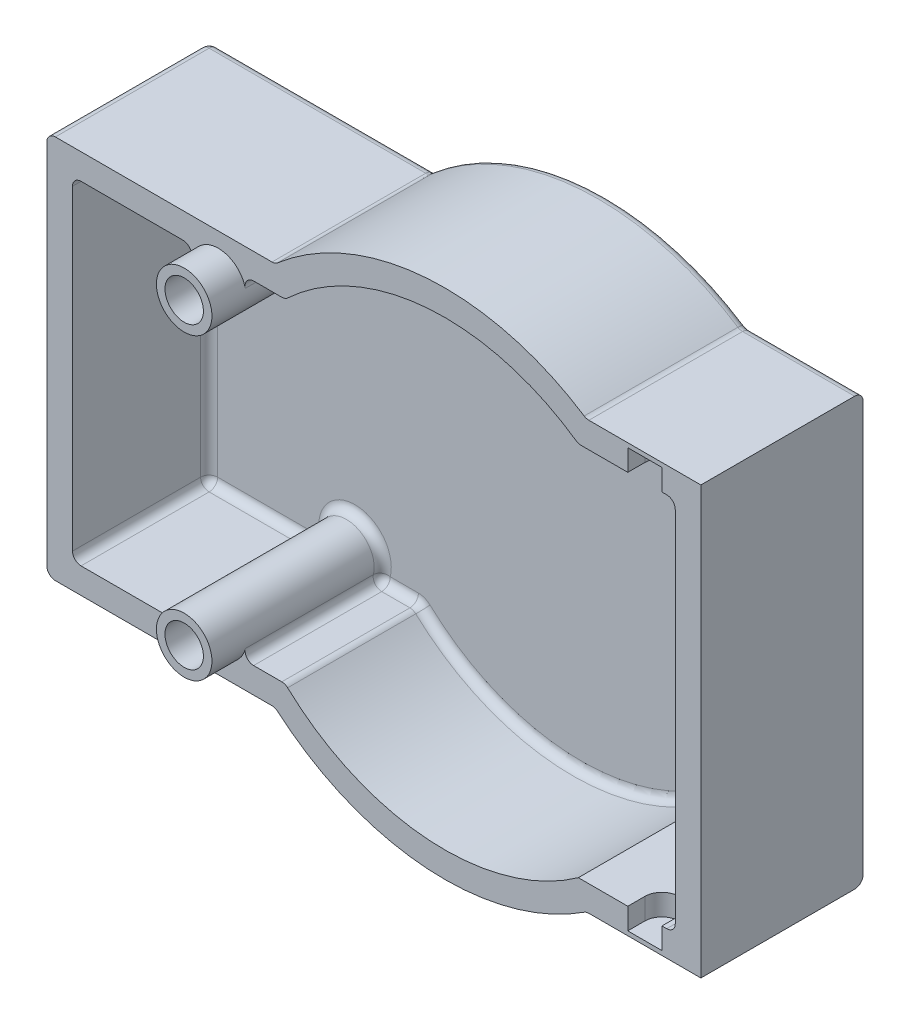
ISO-10303-21;
HEADER;
FILE_DESCRIPTION(('STEP AP214'),'2;1');
FILE_NAME('part.step','',(''),(''),'','','');
FILE_SCHEMA(('AUTOMOTIVE_DESIGN { 1 0 10303 214 1 1 1 1 }'));
ENDSEC;
DATA;
#1=APPLICATION_CONTEXT('core data for automotive mechanical design processes');
#2=APPLICATION_PROTOCOL_DEFINITION('international standard','automotive_design',2000,#1);
#3=PRODUCT_CONTEXT('',#1,'mechanical');
#4=PRODUCT('Part','Part','',(#3));
#5=PRODUCT_RELATED_PRODUCT_CATEGORY('part','',(#4));
#6=PRODUCT_DEFINITION_FORMATION('','',#4);
#7=PRODUCT_DEFINITION_CONTEXT('part definition',#1,'design');
#8=PRODUCT_DEFINITION('design','',#6,#7);
#9=PRODUCT_DEFINITION_SHAPE('','',#8);
#10=(LENGTH_UNIT() NAMED_UNIT(*) SI_UNIT(.MILLI.,.METRE.));
#11=(NAMED_UNIT(*) PLANE_ANGLE_UNIT() SI_UNIT($,.RADIAN.));
#12=(NAMED_UNIT(*) SI_UNIT($,.STERADIAN.) SOLID_ANGLE_UNIT());
#13=UNCERTAINTY_MEASURE_WITH_UNIT(LENGTH_MEASURE(1.E-05),#10,'distance_accuracy_value','');
#14=(GEOMETRIC_REPRESENTATION_CONTEXT(3) GLOBAL_UNCERTAINTY_ASSIGNED_CONTEXT((#13)) GLOBAL_UNIT_ASSIGNED_CONTEXT((#10,
#11,#12)) REPRESENTATION_CONTEXT('',''));
#15=CARTESIAN_POINT('',(0.,0.,0.));
#16=DIRECTION('',(0.,0.,1.));
#17=DIRECTION('',(1.,0.,0.));
#18=AXIS2_PLACEMENT_3D('',#15,#16,#17);
#19=CARTESIAN_POINT('',(-26.503123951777,-17.5,0.));
#20=DIRECTION('',(0.,0.,1.));
#21=DIRECTION('',(1.,0.,0.));
#22=AXIS2_PLACEMENT_3D('',#19,#20,#21);
#23=CYLINDRICAL_SURFACE('',#22,2.25);
#24=CARTESIAN_POINT('',(-26.503123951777,-17.5,23.));
#25=DIRECTION('',(0.,0.,1.));
#26=DIRECTION('',(1.,0.,0.));
#27=AXIS2_PLACEMENT_3D('',#24,#25,#26);
#28=CIRCLE('',#27,2.25);
#29=CARTESIAN_POINT('',(-24.253123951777,-17.5,23.));
#30=VERTEX_POINT('',#29);
#31=EDGE_CURVE('E1213',#30,#30,#28,.T.);
#32=ORIENTED_EDGE('',*,*,#31,.T.);
#33=EDGE_LOOP('',(#32));
#34=FACE_BOUND('',#33,.T.);
#35=CARTESIAN_POINT('',(-26.503123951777,-17.5,2.));
#36=DIRECTION('',(0.,0.,-1.));
#37=DIRECTION('',(-1.,0.,0.));
#38=AXIS2_PLACEMENT_3D('',#35,#36,#37);
#39=CIRCLE('',#38,2.25);
#40=CARTESIAN_POINT('',(-28.753123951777,-17.5,2.));
#41=VERTEX_POINT('',#40);
#42=EDGE_CURVE('E43',#41,#41,#39,.F.);
#43=ORIENTED_EDGE('',*,*,#42,.F.);
#44=EDGE_LOOP('',(#43));
#45=FACE_BOUND('',#44,.T.);
#46=ADVANCED_FACE('F39',(#34,#45),#23,.F.);
#47=CARTESIAN_POINT('',(-26.503123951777,17.5,0.));
#48=DIRECTION('',(0.,0.,1.));
#49=DIRECTION('',(1.,0.,0.));
#50=AXIS2_PLACEMENT_3D('',#47,#48,#49);
#51=CYLINDRICAL_SURFACE('',#50,2.25);
#52=CARTESIAN_POINT('',(-26.503123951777,17.5,23.));
#53=DIRECTION('',(0.,0.,1.));
#54=DIRECTION('',(1.,0.,0.));
#55=AXIS2_PLACEMENT_3D('',#52,#53,#54);
#56=CIRCLE('',#55,2.25);
#57=CARTESIAN_POINT('',(-24.253123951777,17.5,23.));
#58=VERTEX_POINT('',#57);
#59=EDGE_CURVE('E1209',#58,#58,#56,.T.);
#60=ORIENTED_EDGE('',*,*,#59,.T.);
#61=EDGE_LOOP('',(#60));
#62=FACE_BOUND('',#61,.T.);
#63=CARTESIAN_POINT('',(-26.503123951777,17.5,2.));
#64=DIRECTION('',(0.,0.,-1.));
#65=DIRECTION('',(-1.,0.,0.));
#66=AXIS2_PLACEMENT_3D('',#63,#64,#65);
#67=CIRCLE('',#66,2.25);
#68=CARTESIAN_POINT('',(-28.753123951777,17.5,2.));
#69=VERTEX_POINT('',#68);
#70=EDGE_CURVE('E1153',#69,#69,#67,.F.);
#71=ORIENTED_EDGE('',*,*,#70,.F.);
#72=EDGE_LOOP('',(#71));
#73=FACE_BOUND('',#72,.T.);
#74=ADVANCED_FACE('F940',(#62,#73),#51,.F.);
#75=CARTESIAN_POINT('',(-43.583123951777,-19.5,19.));
#76=DIRECTION('',(0.,1.,0.));
#77=DIRECTION('',(0.,0.,1.));
#78=AXIS2_PLACEMENT_3D('',#75,#76,#77);
#79=PLANE('',#78);
#80=DIRECTION('',(0.,0.,-1.));
#81=VECTOR('',#80,1.);
#82=CARTESIAN_POINT('',(-19.0722311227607,-19.5,19.));
#83=LINE('',#82,#81);
#84=CARTESIAN_POINT('',(-19.0722311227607,-19.5,19.));
#85=VERTEX_POINT('',#84);
#86=CARTESIAN_POINT('',(-19.0722311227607,-19.5,4.));
#87=VERTEX_POINT('',#86);
#88=EDGE_CURVE('E533',#85,#87,#83,.T.);
#89=ORIENTED_EDGE('',*,*,#88,.T.);
#90=DIRECTION('',(1.,0.,0.));
#91=VECTOR('',#90,1.);
#92=CARTESIAN_POINT('',(-22.3724460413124,-19.5,4.));
#93=LINE('',#92,#91);
#94=CARTESIAN_POINT('',(-22.3724460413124,-19.5,4.));
#95=VERTEX_POINT('',#94);
#96=EDGE_CURVE('E691',#87,#95,#93,.F.);
#97=ORIENTED_EDGE('',*,*,#96,.T.);
#98=DIRECTION('',(0.,0.,-1.));
#99=VECTOR('',#98,1.);
#100=CARTESIAN_POINT('',(-22.3724460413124,-19.5,19.));
#101=LINE('',#100,#99);
#102=CARTESIAN_POINT('',(-22.3724460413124,-19.5,19.));
#103=VERTEX_POINT('',#102);
#104=EDGE_CURVE('E531',#95,#103,#101,.F.);
#105=ORIENTED_EDGE('',*,*,#104,.T.);
#106=DIRECTION('',(1.,0.,0.));
#107=VECTOR('',#106,1.);
#108=CARTESIAN_POINT('',(-43.583123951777,-19.5,19.));
#109=LINE('',#108,#107);
#110=EDGE_CURVE('E1236',#103,#85,#109,.T.);
#111=ORIENTED_EDGE('',*,*,#110,.T.);
#112=EDGE_LOOP('',(#89,#97,#105,#111));
#113=FACE_BOUND('',#112,.T.);
#114=ADVANCED_FACE('F946',(#113),#79,.T.);
#115=DIRECTION('',(0.,0.,-1.));
#116=VECTOR('',#115,1.);
#117=CARTESIAN_POINT('',(-30.6338018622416,-19.5,19.));
#118=LINE('',#117,#116);
#119=CARTESIAN_POINT('',(-30.6338018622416,-19.5,19.));
#120=VERTEX_POINT('',#119);
#121=CARTESIAN_POINT('',(-30.6338018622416,-19.5,4.));
#122=VERTEX_POINT('',#121);
#123=EDGE_CURVE('E556',#120,#122,#118,.T.);
#124=ORIENTED_EDGE('',*,*,#123,.T.);
#125=DIRECTION('',(1.,0.,0.));
#126=VECTOR('',#125,1.);
#127=CARTESIAN_POINT('',(-42.583123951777,-19.5,4.));
#128=LINE('',#127,#126);
#129=CARTESIAN_POINT('',(-42.583123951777,-19.5,4.));
#130=VERTEX_POINT('',#129);
#131=EDGE_CURVE('E699',#122,#130,#128,.F.);
#132=ORIENTED_EDGE('',*,*,#131,.T.);
#133=DIRECTION('',(0.,0.,-1.));
#134=VECTOR('',#133,1.);
#135=CARTESIAN_POINT('',(-42.583123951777,-19.5,19.));
#136=LINE('',#135,#134);
#137=CARTESIAN_POINT('',(-42.583123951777,-19.5,19.));
#138=VERTEX_POINT('',#137);
#139=EDGE_CURVE('E554',#130,#138,#136,.F.);
#140=ORIENTED_EDGE('',*,*,#139,.T.);
#141=EDGE_CURVE('E1237',#138,#120,#109,.T.);
#142=ORIENTED_EDGE('',*,*,#141,.T.);
#143=EDGE_LOOP('',(#124,#132,#140,#142));
#144=FACE_BOUND('',#143,.T.);
#145=ADVANCED_FACE('F988',(#144),#79,.T.);
#146=CARTESIAN_POINT('',(-18.6748493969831,19.5,19.));
#147=DIRECTION('',(0.,-1.,0.));
#148=DIRECTION('',(0.,0.,-1.));
#149=AXIS2_PLACEMENT_3D('',#146,#147,#148);
#150=PLANE('',#149);
#151=DIRECTION('',(0.,0.,-1.));
#152=VECTOR('',#151,1.);
#153=CARTESIAN_POINT('',(-42.583123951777,19.5,3.));
#154=LINE('',#153,#152);
#155=CARTESIAN_POINT('',(-42.583123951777,19.5,19.));
#156=VERTEX_POINT('',#155);
#157=CARTESIAN_POINT('',(-42.583123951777,19.5,4.));
#158=VERTEX_POINT('',#157);
#159=EDGE_CURVE('E559',#156,#158,#154,.T.);
#160=ORIENTED_EDGE('',*,*,#159,.T.);
#161=DIRECTION('',(-1.,0.,0.));
#162=VECTOR('',#161,1.);
#163=CARTESIAN_POINT('',(-30.6338018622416,19.5,4.));
#164=LINE('',#163,#162);
#165=CARTESIAN_POINT('',(-30.6338018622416,19.5,4.));
#166=VERTEX_POINT('',#165);
#167=EDGE_CURVE('E707',#158,#166,#164,.F.);
#168=ORIENTED_EDGE('',*,*,#167,.T.);
#169=DIRECTION('',(0.,0.,-1.));
#170=VECTOR('',#169,1.);
#171=CARTESIAN_POINT('',(-30.6338018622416,19.5,19.));
#172=LINE('',#171,#170);
#173=CARTESIAN_POINT('',(-30.6338018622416,19.5,19.));
#174=VERTEX_POINT('',#173);
#175=EDGE_CURVE('E562',#166,#174,#172,.F.);
#176=ORIENTED_EDGE('',*,*,#175,.T.);
#177=DIRECTION('',(-1.,0.,0.));
#178=VECTOR('',#177,1.);
#179=CARTESIAN_POINT('',(-18.6748493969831,19.5,19.));
#180=LINE('',#179,#178);
#181=EDGE_CURVE('E1230',#174,#156,#180,.T.);
#182=ORIENTED_EDGE('',*,*,#181,.T.);
#183=EDGE_LOOP('',(#160,#168,#176,#182));
#184=FACE_BOUND('',#183,.T.);
#185=ADVANCED_FACE('F994',(#184),#150,.T.);
#186=DIRECTION('',(0.,0.,-1.));
#187=VECTOR('',#186,1.);
#188=CARTESIAN_POINT('',(-22.3724460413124,19.5,19.));
#189=LINE('',#188,#187);
#190=CARTESIAN_POINT('',(-22.3724460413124,19.5,19.));
#191=VERTEX_POINT('',#190);
#192=CARTESIAN_POINT('',(-22.3724460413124,19.5,4.));
#193=VERTEX_POINT('',#192);
#194=EDGE_CURVE('E571',#191,#193,#189,.T.);
#195=ORIENTED_EDGE('',*,*,#194,.T.);
#196=DIRECTION('',(-1.,0.,0.));
#197=VECTOR('',#196,1.);
#198=CARTESIAN_POINT('',(-19.0722311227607,19.5,4.));
#199=LINE('',#198,#197);
#200=CARTESIAN_POINT('',(-19.0722311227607,19.5,4.));
#201=VERTEX_POINT('',#200);
#202=EDGE_CURVE('E715',#193,#201,#199,.F.);
#203=ORIENTED_EDGE('',*,*,#202,.T.);
#204=DIRECTION('',(0.,0.,-1.));
#205=VECTOR('',#204,1.);
#206=CARTESIAN_POINT('',(-19.0722311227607,19.5,19.));
#207=LINE('',#206,#205);
#208=CARTESIAN_POINT('',(-19.0722311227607,19.5,19.));
#209=VERTEX_POINT('',#208);
#210=EDGE_CURVE('E569',#201,#209,#207,.F.);
#211=ORIENTED_EDGE('',*,*,#210,.T.);
#212=EDGE_CURVE('E1231',#209,#191,#180,.T.);
#213=ORIENTED_EDGE('',*,*,#212,.T.);
#214=EDGE_LOOP('',(#195,#203,#211,#213));
#215=FACE_BOUND('',#214,.T.);
#216=ADVANCED_FACE('F997',(#215),#150,.T.);
#217=CARTESIAN_POINT('',(30.,25.,3.));
#218=DIRECTION('',(0.,-1.,0.));
#219=DIRECTION('',(1.,0.,0.));
#220=AXIS2_PLACEMENT_3D('',#217,#218,#219);
#221=PLANE('',#220);
#222=DIRECTION('',(0.,0.,-1.));
#223=VECTOR('',#222,1.);
#224=CARTESIAN_POINT('',(30.,25.,3.));
#225=LINE('',#224,#223);
#226=CARTESIAN_POINT('',(30.,25.,19.));
#227=VERTEX_POINT('',#226);
#228=CARTESIAN_POINT('',(30.,25.,1.));
#229=VERTEX_POINT('',#228);
#230=EDGE_CURVE('E528',#227,#229,#225,.T.);
#231=ORIENTED_EDGE('',*,*,#230,.T.);
#232=DIRECTION('',(-1.,0.,0.));
#233=VECTOR('',#232,1.);
#234=CARTESIAN_POINT('',(30.,25.,1.));
#235=LINE('',#234,#233);
#236=CARTESIAN_POINT('',(16.8819430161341,25.,1.));
#237=VERTEX_POINT('',#236);
#238=EDGE_CURVE('E727',#229,#237,#235,.T.);
#239=ORIENTED_EDGE('',*,*,#238,.T.);
#240=DIRECTION('',(0.,0.,1.));
#241=VECTOR('',#240,1.);
#242=CARTESIAN_POINT('',(16.8819430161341,25.,19.));
#243=LINE('',#242,#241);
#244=CARTESIAN_POINT('',(16.8819430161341,25.,19.));
#245=VERTEX_POINT('',#244);
#246=EDGE_CURVE('E625',#237,#245,#243,.T.);
#247=ORIENTED_EDGE('',*,*,#246,.T.);
#248=DIRECTION('',(-1.,0.,0.));
#249=VECTOR('',#248,1.);
#250=CARTESIAN_POINT('',(30.,25.,19.));
#251=LINE('',#250,#249);
#252=EDGE_CURVE('E502',#227,#245,#251,.T.);
#253=ORIENTED_EDGE('',*,*,#252,.F.);
#254=EDGE_LOOP('',(#231,#239,#247,#253));
#255=FACE_BOUND('',#254,.T.);
#256=ADVANCED_FACE('F1038',(#255),#221,.F.);
#257=CARTESIAN_POINT('',(0.,0.,3.));
#258=DIRECTION('',(0.,0.,-1.));
#259=DIRECTION('',(-1.,0.,0.));
#260=AXIS2_PLACEMENT_3D('',#257,#258,#259);
#261=CYLINDRICAL_SURFACE('',#260,30.);
#262=DIRECTION('',(0.,0.,-1.));
#263=VECTOR('',#262,1.);
#264=CARTESIAN_POINT('',(16.3373642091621,25.1612903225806,3.));
#265=LINE('',#264,#263);
#266=CARTESIAN_POINT('',(16.3373642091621,25.1612903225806,19.));
#267=VERTEX_POINT('',#266);
#268=CARTESIAN_POINT('',(16.3373642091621,25.1612903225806,1.));
#269=VERTEX_POINT('',#268);
#270=EDGE_CURVE('E622',#267,#269,#265,.T.);
#271=ORIENTED_EDGE('',*,*,#270,.T.);
#272=CARTESIAN_POINT('',(0.,0.,1.));
#273=DIRECTION('',(0.,0.,1.));
#274=DIRECTION('',(1.,0.,0.));
#275=AXIS2_PLACEMENT_3D('',#272,#273,#274);
#276=CIRCLE('',#275,30.);
#277=CARTESIAN_POINT('',(-19.5653870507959,22.741935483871,1.));
#278=VERTEX_POINT('',#277);
#279=EDGE_CURVE('E12',#269,#278,#276,.T.);
#280=ORIENTED_EDGE('',*,*,#279,.T.);
#281=DIRECTION('',(0.,0.,-1.));
#282=VECTOR('',#281,1.);
#283=CARTESIAN_POINT('',(-19.5653870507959,22.741935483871,3.));
#284=LINE('',#283,#282);
#285=CARTESIAN_POINT('',(-19.5653870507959,22.741935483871,19.));
#286=VERTEX_POINT('',#285);
#287=EDGE_CURVE('E620',#278,#286,#284,.F.);
#288=ORIENTED_EDGE('',*,*,#287,.T.);
#289=CARTESIAN_POINT('',(0.,0.,19.));
#290=DIRECTION('',(0.,0.,1.));
#291=DIRECTION('',(1.,0.,0.));
#292=AXIS2_PLACEMENT_3D('',#289,#290,#291);
#293=CIRCLE('',#292,30.);
#294=EDGE_CURVE('E505',#267,#286,#293,.T.);
#295=ORIENTED_EDGE('',*,*,#294,.F.);
#296=EDGE_LOOP('',(#271,#280,#288,#295));
#297=FACE_BOUND('',#296,.T.);
#298=ADVANCED_FACE('F1034',(#297),#261,.T.);
#299=CARTESIAN_POINT('',(-19.8431348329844,22.5,3.));
#300=DIRECTION('',(0.,-1.,0.));
#301=DIRECTION('',(0.,0.,-1.));
#302=AXIS2_PLACEMENT_3D('',#299,#300,#301);
#303=PLANE('',#302);
#304=DIRECTION('',(0.,0.,1.));
#305=VECTOR('',#304,1.);
#306=CARTESIAN_POINT('',(-20.2175666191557,22.5,0.));
#307=LINE('',#306,#305);
#308=CARTESIAN_POINT('',(-20.2175666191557,22.5,19.));
#309=VERTEX_POINT('',#308);
#310=CARTESIAN_POINT('',(-20.2175666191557,22.5,1.));
#311=VERTEX_POINT('',#310);
#312=EDGE_CURVE('E607',#309,#311,#307,.F.);
#313=ORIENTED_EDGE('',*,*,#312,.T.);
#314=DIRECTION('',(-1.,0.,0.));
#315=VECTOR('',#314,1.);
#316=CARTESIAN_POINT('',(-19.8431348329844,22.5,1.));
#317=LINE('',#316,#315);
#318=CARTESIAN_POINT('',(-45.583123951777,22.5,1.));
#319=VERTEX_POINT('',#318);
#320=EDGE_CURVE('E774',#311,#319,#317,.T.);
#321=ORIENTED_EDGE('',*,*,#320,.T.);
#322=DIRECTION('',(0.,0.,-1.));
#323=VECTOR('',#322,1.);
#324=CARTESIAN_POINT('',(-45.583123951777,22.5,3.));
#325=LINE('',#324,#323);
#326=CARTESIAN_POINT('',(-45.583123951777,22.5,19.));
#327=VERTEX_POINT('',#326);
#328=EDGE_CURVE('E610',#319,#327,#325,.F.);
#329=ORIENTED_EDGE('',*,*,#328,.T.);
#330=DIRECTION('',(-1.,0.,0.));
#331=VECTOR('',#330,1.);
#332=CARTESIAN_POINT('',(-19.8431348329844,22.5,19.));
#333=LINE('',#332,#331);
#334=EDGE_CURVE('E508',#309,#327,#333,.T.);
#335=ORIENTED_EDGE('',*,*,#334,.F.);
#336=EDGE_LOOP('',(#313,#321,#329,#335));
#337=FACE_BOUND('',#336,.T.);
#338=ADVANCED_FACE('F1030',(#337),#303,.F.);
#339=CARTESIAN_POINT('',(-46.583123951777,22.5,3.));
#340=DIRECTION('',(1.,0.,0.));
#341=DIRECTION('',(0.,0.,-1.));
#342=AXIS2_PLACEMENT_3D('',#339,#340,#341);
#343=PLANE('',#342);
#344=DIRECTION('',(0.,0.,-1.));
#345=VECTOR('',#344,1.);
#346=CARTESIAN_POINT('',(-46.583123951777,21.5,3.));
#347=LINE('',#346,#345);
#348=CARTESIAN_POINT('',(-46.583123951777,21.5,19.));
#349=VERTEX_POINT('',#348);
#350=CARTESIAN_POINT('',(-46.583123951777,21.5,1.));
#351=VERTEX_POINT('',#350);
#352=EDGE_CURVE('E602',#349,#351,#347,.T.);
#353=ORIENTED_EDGE('',*,*,#352,.T.);
#354=DIRECTION('',(0.,-1.,0.));
#355=VECTOR('',#354,1.);
#356=CARTESIAN_POINT('',(-46.583123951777,22.5,1.));
#357=LINE('',#356,#355);
#358=CARTESIAN_POINT('',(-46.583123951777,-21.5,1.));
#359=VERTEX_POINT('',#358);
#360=EDGE_CURVE('E770',#351,#359,#357,.T.);
#361=ORIENTED_EDGE('',*,*,#360,.T.);
#362=DIRECTION('',(0.,0.,-1.));
#363=VECTOR('',#362,1.);
#364=CARTESIAN_POINT('',(-46.583123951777,-21.5,3.));
#365=LINE('',#364,#363);
#366=CARTESIAN_POINT('',(-46.583123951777,-21.5,19.));
#367=VERTEX_POINT('',#366);
#368=EDGE_CURVE('E605',#359,#367,#365,.F.);
#369=ORIENTED_EDGE('',*,*,#368,.T.);
#370=DIRECTION('',(0.,-1.,0.));
#371=VECTOR('',#370,1.);
#372=CARTESIAN_POINT('',(-46.583123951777,22.5,19.));
#373=LINE('',#372,#371);
#374=EDGE_CURVE('E511',#349,#367,#373,.T.);
#375=ORIENTED_EDGE('',*,*,#374,.F.);
#376=EDGE_LOOP('',(#353,#361,#369,#375));
#377=FACE_BOUND('',#376,.T.);
#378=ADVANCED_FACE('F1026',(#377),#343,.F.);
#379=CARTESIAN_POINT('',(-46.583123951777,-22.5,3.));
#380=DIRECTION('',(0.,1.,0.));
#381=DIRECTION('',(0.,0.,1.));
#382=AXIS2_PLACEMENT_3D('',#379,#380,#381);
#383=PLANE('',#382);
#384=DIRECTION('',(0.,0.,-1.));
#385=VECTOR('',#384,1.);
#386=CARTESIAN_POINT('',(-45.583123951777,-22.5,3.));
#387=LINE('',#386,#385);
#388=CARTESIAN_POINT('',(-45.583123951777,-22.5,19.));
#389=VERTEX_POINT('',#388);
#390=CARTESIAN_POINT('',(-45.583123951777,-22.5,1.));
#391=VERTEX_POINT('',#390);
#392=EDGE_CURVE('E599',#389,#391,#387,.T.);
#393=ORIENTED_EDGE('',*,*,#392,.T.);
#394=DIRECTION('',(1.,0.,0.));
#395=VECTOR('',#394,1.);
#396=CARTESIAN_POINT('',(-46.583123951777,-22.5,1.));
#397=LINE('',#396,#395);
#398=CARTESIAN_POINT('',(-20.2175666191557,-22.5,1.));
#399=VERTEX_POINT('',#398);
#400=EDGE_CURVE('E766',#391,#399,#397,.T.);
#401=ORIENTED_EDGE('',*,*,#400,.T.);
#402=DIRECTION('',(0.,0.,1.));
#403=VECTOR('',#402,1.);
#404=CARTESIAN_POINT('',(-20.2175666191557,-22.5,19.));
#405=LINE('',#404,#403);
#406=CARTESIAN_POINT('',(-20.2175666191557,-22.5,19.));
#407=VERTEX_POINT('',#406);
#408=EDGE_CURVE('E597',#399,#407,#405,.T.);
#409=ORIENTED_EDGE('',*,*,#408,.T.);
#410=DIRECTION('',(1.,0.,0.));
#411=VECTOR('',#410,1.);
#412=CARTESIAN_POINT('',(-46.583123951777,-22.5,19.));
#413=LINE('',#412,#411);
#414=EDGE_CURVE('E514',#389,#407,#413,.T.);
#415=ORIENTED_EDGE('',*,*,#414,.F.);
#416=EDGE_LOOP('',(#393,#401,#409,#415));
#417=FACE_BOUND('',#416,.T.);
#418=ADVANCED_FACE('F1022',(#417),#383,.F.);
#419=CARTESIAN_POINT('',(0.,0.,3.));
#420=DIRECTION('',(0.,0.,-1.));
#421=DIRECTION('',(-1.,0.,0.));
#422=AXIS2_PLACEMENT_3D('',#419,#420,#421);
#423=CYLINDRICAL_SURFACE('',#422,30.);
#424=DIRECTION('',(0.,0.,-1.));
#425=VECTOR('',#424,1.);
#426=CARTESIAN_POINT('',(-19.5653870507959,-22.741935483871,3.));
#427=LINE('',#426,#425);
#428=CARTESIAN_POINT('',(-19.5653870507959,-22.741935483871,19.));
#429=VERTEX_POINT('',#428);
#430=CARTESIAN_POINT('',(-19.5653870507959,-22.741935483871,1.));
#431=VERTEX_POINT('',#430);
#432=EDGE_CURVE('E615',#429,#431,#427,.T.);
#433=ORIENTED_EDGE('',*,*,#432,.T.);
#434=CARTESIAN_POINT('',(0.,0.,1.));
#435=DIRECTION('',(0.,0.,1.));
#436=DIRECTION('',(1.,0.,0.));
#437=AXIS2_PLACEMENT_3D('',#434,#435,#436);
#438=CIRCLE('',#437,30.);
#439=CARTESIAN_POINT('',(16.3373642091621,-25.1612903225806,1.));
#440=VERTEX_POINT('',#439);
#441=EDGE_CURVE('E762',#431,#440,#438,.T.);
#442=ORIENTED_EDGE('',*,*,#441,.T.);
#443=DIRECTION('',(0.,0.,-1.));
#444=VECTOR('',#443,1.);
#445=CARTESIAN_POINT('',(16.3373642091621,-25.1612903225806,3.));
#446=LINE('',#445,#444);
#447=CARTESIAN_POINT('',(16.3373642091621,-25.1612903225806,19.));
#448=VERTEX_POINT('',#447);
#449=EDGE_CURVE('E618',#440,#448,#446,.F.);
#450=ORIENTED_EDGE('',*,*,#449,.T.);
#451=CARTESIAN_POINT('',(0.,0.,19.));
#452=DIRECTION('',(0.,0.,1.));
#453=DIRECTION('',(1.,0.,0.));
#454=AXIS2_PLACEMENT_3D('',#451,#452,#453);
#455=CIRCLE('',#454,30.);
#456=EDGE_CURVE('E517',#429,#448,#455,.T.);
#457=ORIENTED_EDGE('',*,*,#456,.F.);
#458=EDGE_LOOP('',(#433,#442,#450,#457));
#459=FACE_BOUND('',#458,.T.);
#460=ADVANCED_FACE('F1018',(#459),#423,.T.);
#461=CARTESIAN_POINT('',(30.,-25.,3.));
#462=DIRECTION('',(0.,1.,0.));
#463=DIRECTION('',(-1.,0.,0.));
#464=AXIS2_PLACEMENT_3D('',#461,#462,#463);
#465=PLANE('',#464);
#466=DIRECTION('',(0.,0.,1.));
#467=VECTOR('',#466,1.);
#468=CARTESIAN_POINT('',(16.8819430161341,-25.,0.));
#469=LINE('',#468,#467);
#470=CARTESIAN_POINT('',(16.8819430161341,-25.,19.));
#471=VERTEX_POINT('',#470);
#472=CARTESIAN_POINT('',(16.8819430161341,-25.,1.));
#473=VERTEX_POINT('',#472);
#474=EDGE_CURVE('E612',#471,#473,#469,.F.);
#475=ORIENTED_EDGE('',*,*,#474,.T.);
#476=DIRECTION('',(1.,0.,0.));
#477=VECTOR('',#476,1.);
#478=CARTESIAN_POINT('',(30.,-25.,1.));
#479=LINE('',#478,#477);
#480=CARTESIAN_POINT('',(30.,-25.,1.));
#481=VERTEX_POINT('',#480);
#482=EDGE_CURVE('E758',#473,#481,#479,.T.);
#483=ORIENTED_EDGE('',*,*,#482,.T.);
#484=DIRECTION('',(0.,0.,-1.));
#485=VECTOR('',#484,1.);
#486=CARTESIAN_POINT('',(30.,-25.,3.));
#487=LINE('',#486,#485);
#488=CARTESIAN_POINT('',(30.,-25.,19.));
#489=VERTEX_POINT('',#488);
#490=EDGE_CURVE('E525',#489,#481,#487,.T.);
#491=ORIENTED_EDGE('',*,*,#490,.F.);
#492=DIRECTION('',(1.,0.,0.));
#493=VECTOR('',#492,1.);
#494=CARTESIAN_POINT('',(16.583123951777,-25.,19.));
#495=LINE('',#494,#493);
#496=EDGE_CURVE('E520',#471,#489,#495,.T.);
#497=ORIENTED_EDGE('',*,*,#496,.F.);
#498=EDGE_LOOP('',(#475,#483,#491,#497));
#499=FACE_BOUND('',#498,.T.);
#500=ADVANCED_FACE('F1014',(#499),#465,.F.);
#501=CARTESIAN_POINT('',(30.,0.,3.));
#502=DIRECTION('',(-1.,0.,0.));
#503=DIRECTION('',(0.,-1.,0.));
#504=AXIS2_PLACEMENT_3D('',#501,#502,#503);
#505=PLANE('',#504);
#506=DIRECTION('',(0.,1.,0.));
#507=VECTOR('',#506,1.);
#508=CARTESIAN_POINT('',(30.,0.,0.));
#509=LINE('',#508,#507);
#510=CARTESIAN_POINT('',(30.,-24.,0.));
#511=VERTEX_POINT('',#510);
#512=CARTESIAN_POINT('',(30.,24.,0.));
#513=VERTEX_POINT('',#512);
#514=EDGE_CURVE('E522',#511,#513,#509,.T.);
#515=ORIENTED_EDGE('',*,*,#514,.T.);
#516=CARTESIAN_POINT('',(30.,24.,1.));
#517=DIRECTION('',(-1.,0.,0.));
#518=DIRECTION('',(0.,-1.,0.));
#519=AXIS2_PLACEMENT_3D('',#516,#517,#518);
#520=CIRCLE('',#519,1.);
#521=EDGE_CURVE('E754',#513,#229,#520,.F.);
#522=ORIENTED_EDGE('',*,*,#521,.T.);
#523=ORIENTED_EDGE('',*,*,#230,.F.);
#524=DIRECTION('',(0.,1.,0.));
#525=VECTOR('',#524,1.);
#526=CARTESIAN_POINT('',(30.,-25.,19.));
#527=LINE('',#526,#525);
#528=EDGE_CURVE('E499',#489,#227,#527,.T.);
#529=ORIENTED_EDGE('',*,*,#528,.F.);
#530=ORIENTED_EDGE('',*,*,#490,.T.);
#531=CARTESIAN_POINT('',(30.,-24.,1.));
#532=DIRECTION('',(-1.,0.,0.));
#533=DIRECTION('',(0.,-1.,0.));
#534=AXIS2_PLACEMENT_3D('',#531,#532,#533);
#535=CIRCLE('',#534,1.);
#536=EDGE_CURVE('E752',#481,#511,#535,.F.);
#537=ORIENTED_EDGE('',*,*,#536,.T.);
#538=EDGE_LOOP('',(#515,#522,#523,#529,#530,#537));
#539=FACE_BOUND('',#538,.T.);
#540=ADVANCED_FACE('F1010',(#539),#505,.F.);
#541=CARTESIAN_POINT('',(0.,0.,0.));
#542=DIRECTION('',(0.,0.,1.));
#543=DIRECTION('',(1.,0.,0.));
#544=AXIS2_PLACEMENT_3D('',#541,#542,#543);
#545=PLANE('',#544);
#546=DIRECTION('',(1.,0.,0.));
#547=VECTOR('',#546,1.);
#548=CARTESIAN_POINT('',(-23.003123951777,21.,0.));
#549=LINE('',#548,#547);
#550=CARTESIAN_POINT('',(-30.003123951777,21.,0.));
#551=VERTEX_POINT('',#550);
#552=CARTESIAN_POINT('',(-23.003123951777,21.,0.));
#553=VERTEX_POINT('',#552);
#554=EDGE_CURVE('E1449',#551,#553,#549,.T.);
#555=ORIENTED_EDGE('',*,*,#554,.F.);
#556=DIRECTION('',(0.,1.,0.));
#557=VECTOR('',#556,1.);
#558=CARTESIAN_POINT('',(-30.003123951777,21.,0.));
#559=LINE('',#558,#557);
#560=CARTESIAN_POINT('',(-30.003123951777,14.,0.));
#561=VERTEX_POINT('',#560);
#562=EDGE_CURVE('E1202',#561,#551,#559,.T.);
#563=ORIENTED_EDGE('',*,*,#562,.F.);
#564=DIRECTION('',(-1.,0.,0.));
#565=VECTOR('',#564,1.);
#566=CARTESIAN_POINT('',(-23.003123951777,14.,0.));
#567=LINE('',#566,#565);
#568=CARTESIAN_POINT('',(-23.003123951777,14.,0.));
#569=VERTEX_POINT('',#568);
#570=EDGE_CURVE('E1167',#569,#561,#567,.T.);
#571=ORIENTED_EDGE('',*,*,#570,.F.);
#572=DIRECTION('',(0.,-1.,0.));
#573=VECTOR('',#572,1.);
#574=CARTESIAN_POINT('',(-23.003123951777,21.,0.));
#575=LINE('',#574,#573);
#576=EDGE_CURVE('E1451',#553,#569,#575,.T.);
#577=ORIENTED_EDGE('',*,*,#576,.F.);
#578=EDGE_LOOP('',(#555,#563,#571,#577));
#579=FACE_BOUND('',#578,.T.);
#580=DIRECTION('',(1.,0.,0.));
#581=VECTOR('',#580,1.);
#582=CARTESIAN_POINT('',(-23.003123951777,-14.,0.));
#583=LINE('',#582,#581);
#584=CARTESIAN_POINT('',(-30.003123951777,-14.,0.));
#585=VERTEX_POINT('',#584);
#586=CARTESIAN_POINT('',(-23.003123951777,-14.,0.));
#587=VERTEX_POINT('',#586);
#588=EDGE_CURVE('E1191',#585,#587,#583,.T.);
#589=ORIENTED_EDGE('',*,*,#588,.F.);
#590=DIRECTION('',(0.,1.,0.));
#591=VECTOR('',#590,1.);
#592=CARTESIAN_POINT('',(-30.003123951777,-14.,0.));
#593=LINE('',#592,#591);
#594=CARTESIAN_POINT('',(-30.003123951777,-21.,0.));
#595=VERTEX_POINT('',#594);
#596=EDGE_CURVE('E1189',#595,#585,#593,.T.);
#597=ORIENTED_EDGE('',*,*,#596,.F.);
#598=DIRECTION('',(-1.,0.,0.));
#599=VECTOR('',#598,1.);
#600=CARTESIAN_POINT('',(-23.003123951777,-21.,0.));
#601=LINE('',#600,#599);
#602=CARTESIAN_POINT('',(-23.003123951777,-21.,0.));
#603=VERTEX_POINT('',#602);
#604=EDGE_CURVE('E1179',#603,#595,#601,.T.);
#605=ORIENTED_EDGE('',*,*,#604,.F.);
#606=DIRECTION('',(0.,-1.,0.));
#607=VECTOR('',#606,1.);
#608=CARTESIAN_POINT('',(-23.003123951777,-14.,0.));
#609=LINE('',#608,#607);
#610=EDGE_CURVE('E1195',#587,#603,#609,.T.);
#611=ORIENTED_EDGE('',*,*,#610,.F.);
#612=EDGE_LOOP('',(#589,#597,#605,#611));
#613=FACE_BOUND('',#612,.T.);
#614=CARTESIAN_POINT('',(16.8819430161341,26.,0.));
#615=DIRECTION('',(0.,0.,1.));
#616=DIRECTION('',(1.,0.,0.));
#617=AXIS2_PLACEMENT_3D('',#614,#615,#616);
#618=CIRCLE('',#617,2.);
#619=CARTESIAN_POINT('',(15.79278540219,24.3225806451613,0.));
#620=VERTEX_POINT('',#619);
#621=CARTESIAN_POINT('',(16.8819430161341,24.,0.));
#622=VERTEX_POINT('',#621);
#623=EDGE_CURVE('E748',#620,#622,#618,.T.);
#624=ORIENTED_EDGE('',*,*,#623,.T.);
#625=DIRECTION('',(-1.,0.,0.));
#626=VECTOR('',#625,1.);
#627=CARTESIAN_POINT('',(0.,24.,0.));
#628=LINE('',#627,#626);
#629=EDGE_CURVE('E750',#622,#513,#628,.F.);
#630=ORIENTED_EDGE('',*,*,#629,.T.);
#631=ORIENTED_EDGE('',*,*,#514,.F.);
#632=DIRECTION('',(1.,0.,0.));
#633=VECTOR('',#632,1.);
#634=CARTESIAN_POINT('',(0.,-24.,0.));
#635=LINE('',#634,#633);
#636=CARTESIAN_POINT('',(16.8819430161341,-24.,0.));
#637=VERTEX_POINT('',#636);
#638=EDGE_CURVE('E746',#511,#637,#635,.F.);
#639=ORIENTED_EDGE('',*,*,#638,.T.);
#640=CARTESIAN_POINT('',(16.8819430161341,-26.,0.));
#641=DIRECTION('',(0.,0.,1.));
#642=DIRECTION('',(1.,0.,0.));
#643=AXIS2_PLACEMENT_3D('',#640,#641,#642);
#644=CIRCLE('',#643,2.);
#645=CARTESIAN_POINT('',(15.79278540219,-24.3225806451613,0.));
#646=VERTEX_POINT('',#645);
#647=EDGE_CURVE('E744',#637,#646,#644,.T.);
#648=ORIENTED_EDGE('',*,*,#647,.T.);
#649=CARTESIAN_POINT('',(0.,0.,0.));
#650=DIRECTION('',(0.,0.,1.));
#651=DIRECTION('',(1.,0.,0.));
#652=AXIS2_PLACEMENT_3D('',#649,#650,#651);
#653=CIRCLE('',#652,29.);
#654=CARTESIAN_POINT('',(-18.913207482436,-21.9838709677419,0.));
#655=VERTEX_POINT('',#654);
#656=EDGE_CURVE('E742',#646,#655,#653,.F.);
#657=ORIENTED_EDGE('',*,*,#656,.T.);
#658=CARTESIAN_POINT('',(-20.2175666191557,-23.5,0.));
#659=DIRECTION('',(0.,0.,1.));
#660=DIRECTION('',(1.,0.,0.));
#661=AXIS2_PLACEMENT_3D('',#658,#659,#660);
#662=CIRCLE('',#661,2.);
#663=CARTESIAN_POINT('',(-20.2175666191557,-21.5,0.));
#664=VERTEX_POINT('',#663);
#665=EDGE_CURVE('E740',#655,#664,#662,.T.);
#666=ORIENTED_EDGE('',*,*,#665,.T.);
#667=DIRECTION('',(1.,0.,0.));
#668=VECTOR('',#667,1.);
#669=CARTESIAN_POINT('',(0.,-21.5,0.));
#670=LINE('',#669,#668);
#671=CARTESIAN_POINT('',(-45.583123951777,-21.5,0.));
#672=VERTEX_POINT('',#671);
#673=EDGE_CURVE('E738',#664,#672,#670,.F.);
#674=ORIENTED_EDGE('',*,*,#673,.T.);
#675=DIRECTION('',(0.,-1.,0.));
#676=VECTOR('',#675,1.);
#677=CARTESIAN_POINT('',(-45.583123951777,0.,0.));
#678=LINE('',#677,#676);
#679=CARTESIAN_POINT('',(-45.583123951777,21.5,0.));
#680=VERTEX_POINT('',#679);
#681=EDGE_CURVE('E736',#672,#680,#678,.F.);
#682=ORIENTED_EDGE('',*,*,#681,.T.);
#683=DIRECTION('',(-1.,0.,0.));
#684=VECTOR('',#683,1.);
#685=CARTESIAN_POINT('',(0.,21.5,0.));
#686=LINE('',#685,#684);
#687=CARTESIAN_POINT('',(-20.2175666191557,21.5,0.));
#688=VERTEX_POINT('',#687);
#689=EDGE_CURVE('E734',#680,#688,#686,.F.);
#690=ORIENTED_EDGE('',*,*,#689,.T.);
#691=CARTESIAN_POINT('',(-20.2175666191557,23.5,0.));
#692=DIRECTION('',(0.,0.,1.));
#693=DIRECTION('',(1.,0.,0.));
#694=AXIS2_PLACEMENT_3D('',#691,#692,#693);
#695=CIRCLE('',#694,2.);
#696=CARTESIAN_POINT('',(-18.913207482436,21.9838709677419,0.));
#697=VERTEX_POINT('',#696);
#698=EDGE_CURVE('E732',#688,#697,#695,.T.);
#699=ORIENTED_EDGE('',*,*,#698,.T.);
#700=CARTESIAN_POINT('',(0.,0.,0.));
#701=DIRECTION('',(0.,0.,1.));
#702=DIRECTION('',(1.,0.,0.));
#703=AXIS2_PLACEMENT_3D('',#700,#701,#702);
#704=CIRCLE('',#703,29.);
#705=EDGE_CURVE('E730',#697,#620,#704,.F.);
#706=ORIENTED_EDGE('',*,*,#705,.T.);
#707=EDGE_LOOP('',(#624,#630,#631,#639,#648,#657,#666,#674,#682,#690,#699,#706));
#708=FACE_BOUND('',#707,.T.);
#709=ADVANCED_FACE('F1004',(#579,#613,#708),#545,.F.);
#710=CARTESIAN_POINT('',(0.,0.,19.));
#711=DIRECTION('',(0.,0.,1.));
#712=DIRECTION('',(1.,0.,0.));
#713=AXIS2_PLACEMENT_3D('',#710,#711,#712);
#714=PLANE('',#713);
#715=DIRECTION('',(0.,1.,0.));
#716=VECTOR('',#715,1.);
#717=CARTESIAN_POINT('',(25.4409715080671,-30.6568542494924,19.));
#718=LINE('',#717,#716);
#719=CARTESIAN_POINT('',(25.4409715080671,-24.5,19.));
#720=VERTEX_POINT('',#719);
#721=CARTESIAN_POINT('',(25.4409715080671,-22.,19.));
#722=VERTEX_POINT('',#721);
#723=EDGE_CURVE('E477',#720,#722,#718,.T.);
#724=ORIENTED_EDGE('',*,*,#723,.F.);
#725=DIRECTION('',(-1.,0.,0.));
#726=VECTOR('',#725,1.);
#727=CARTESIAN_POINT('',(15.6524758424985,-24.5,19.));
#728=LINE('',#727,#726);
#729=CARTESIAN_POINT('',(21.4409715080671,-24.5,19.));
#730=VERTEX_POINT('',#729);
#731=EDGE_CURVE('E476',#720,#730,#728,.T.);
#732=ORIENTED_EDGE('',*,*,#731,.T.);
#733=DIRECTION('',(0.,1.,0.));
#734=VECTOR('',#733,1.);
#735=CARTESIAN_POINT('',(21.4409715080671,-30.6568542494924,19.));
#736=LINE('',#735,#734);
#737=CARTESIAN_POINT('',(21.4409715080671,-22.,19.));
#738=VERTEX_POINT('',#737);
#739=EDGE_CURVE('E460',#730,#738,#736,.T.);
#740=ORIENTED_EDGE('',*,*,#739,.T.);
#741=DIRECTION('',(1.,0.,0.));
#742=VECTOR('',#741,1.);
#743=CARTESIAN_POINT('',(15.6524758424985,-22.,19.));
#744=LINE('',#743,#742);
#745=CARTESIAN_POINT('',(15.6524758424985,-22.,19.));
#746=VERTEX_POINT('',#745);
#747=EDGE_CURVE('E474',#746,#738,#744,.T.);
#748=ORIENTED_EDGE('',*,*,#747,.F.);
#749=CARTESIAN_POINT('',(0.,0.,19.));
#750=DIRECTION('',(0.,0.,1.));
#751=DIRECTION('',(1.,0.,0.));
#752=AXIS2_PLACEMENT_3D('',#749,#750,#751);
#753=CIRCLE('',#752,27.);
#754=CARTESIAN_POINT('',(-18.3910800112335,-19.7678571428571,19.));
#755=VERTEX_POINT('',#754);
#756=EDGE_CURVE('E491',#755,#746,#753,.T.);
#757=ORIENTED_EDGE('',*,*,#756,.F.);
#758=CARTESIAN_POINT('',(-19.0722311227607,-20.5,19.));
#759=DIRECTION('',(0.,0.,1.));
#760=DIRECTION('',(1.,0.,0.));
#761=AXIS2_PLACEMENT_3D('',#758,#759,#760);
#762=CIRCLE('',#761,1.);
#763=EDGE_CURVE('E547',#755,#85,#762,.T.);
#764=ORIENTED_EDGE('',*,*,#763,.T.);
#765=ORIENTED_EDGE('',*,*,#110,.F.);
#766=CARTESIAN_POINT('',(-22.3724460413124,-18.5,19.));
#767=DIRECTION('',(0.,0.,1.));
#768=DIRECTION('',(1.,0.,0.));
#769=AXIS2_PLACEMENT_3D('',#766,#767,#768);
#770=CIRCLE('',#769,1.);
#771=CARTESIAN_POINT('',(-23.3443702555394,-18.2647058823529,19.));
#772=VERTEX_POINT('',#771);
#773=EDGE_CURVE('E627',#103,#772,#770,.F.);
#774=ORIENTED_EDGE('',*,*,#773,.T.);
#775=CARTESIAN_POINT('',(-26.503123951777,-17.5,19.));
#776=DIRECTION('',(0.,0.,1.));
#777=DIRECTION('',(1.,0.,0.));
#778=AXIS2_PLACEMENT_3D('',#775,#776,#777);
#779=CIRCLE('',#778,3.25);
#780=CARTESIAN_POINT('',(-29.6618776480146,-18.2647058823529,19.));
#781=VERTEX_POINT('',#780);
#782=EDGE_CURVE('E1218',#772,#781,#779,.F.);
#783=ORIENTED_EDGE('',*,*,#782,.T.);
#784=CARTESIAN_POINT('',(-30.6338018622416,-18.5,19.));
#785=DIRECTION('',(0.,0.,1.));
#786=DIRECTION('',(1.,0.,0.));
#787=AXIS2_PLACEMENT_3D('',#784,#785,#786);
#788=CIRCLE('',#787,1.);
#789=EDGE_CURVE('E630',#781,#120,#788,.F.);
#790=ORIENTED_EDGE('',*,*,#789,.T.);
#791=ORIENTED_EDGE('',*,*,#141,.F.);
#792=CARTESIAN_POINT('',(-42.583123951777,-18.5,19.));
#793=DIRECTION('',(0.,0.,1.));
#794=DIRECTION('',(1.,0.,0.));
#795=AXIS2_PLACEMENT_3D('',#792,#793,#794);
#796=CIRCLE('',#795,1.);
#797=CARTESIAN_POINT('',(-43.583123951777,-18.5,19.));
#798=VERTEX_POINT('',#797);
#799=EDGE_CURVE('E637',#138,#798,#796,.F.);
#800=ORIENTED_EDGE('',*,*,#799,.T.);
#801=DIRECTION('',(0.,-1.,0.));
#802=VECTOR('',#801,1.);
#803=CARTESIAN_POINT('',(-43.583123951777,19.5,19.));
#804=LINE('',#803,#802);
#805=CARTESIAN_POINT('',(-43.583123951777,18.5,19.));
#806=VERTEX_POINT('',#805);
#807=EDGE_CURVE('E1234',#806,#798,#804,.T.);
#808=ORIENTED_EDGE('',*,*,#807,.F.);
#809=CARTESIAN_POINT('',(-42.583123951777,18.5,19.));
#810=DIRECTION('',(0.,0.,1.));
#811=DIRECTION('',(1.,0.,0.));
#812=AXIS2_PLACEMENT_3D('',#809,#810,#811);
#813=CIRCLE('',#812,1.);
#814=EDGE_CURVE('E639',#806,#156,#813,.F.);
#815=ORIENTED_EDGE('',*,*,#814,.T.);
#816=ORIENTED_EDGE('',*,*,#181,.F.);
#817=CARTESIAN_POINT('',(-30.6338018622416,18.5,19.));
#818=DIRECTION('',(0.,0.,1.));
#819=DIRECTION('',(1.,0.,0.));
#820=AXIS2_PLACEMENT_3D('',#817,#818,#819);
#821=CIRCLE('',#820,1.);
#822=CARTESIAN_POINT('',(-29.6618776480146,18.2647058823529,19.));
#823=VERTEX_POINT('',#822);
#824=EDGE_CURVE('E632',#174,#823,#821,.F.);
#825=ORIENTED_EDGE('',*,*,#824,.T.);
#826=CARTESIAN_POINT('',(-26.503123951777,17.5,19.));
#827=DIRECTION('',(0.,0.,1.));
#828=DIRECTION('',(1.,0.,0.));
#829=AXIS2_PLACEMENT_3D('',#826,#827,#828);
#830=CIRCLE('',#829,3.25);
#831=CARTESIAN_POINT('',(-23.3443702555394,18.2647058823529,19.));
#832=VERTEX_POINT('',#831);
#833=EDGE_CURVE('E1224',#823,#832,#830,.F.);
#834=ORIENTED_EDGE('',*,*,#833,.T.);
#835=CARTESIAN_POINT('',(-22.3724460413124,18.5,19.));
#836=DIRECTION('',(0.,0.,1.));
#837=DIRECTION('',(1.,0.,0.));
#838=AXIS2_PLACEMENT_3D('',#835,#836,#837);
#839=CIRCLE('',#838,1.);
#840=EDGE_CURVE('E635',#832,#191,#839,.F.);
#841=ORIENTED_EDGE('',*,*,#840,.T.);
#842=ORIENTED_EDGE('',*,*,#212,.F.);
#843=CARTESIAN_POINT('',(-19.0722311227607,20.5,19.));
#844=DIRECTION('',(0.,0.,1.));
#845=DIRECTION('',(1.,0.,0.));
#846=AXIS2_PLACEMENT_3D('',#843,#844,#845);
#847=CIRCLE('',#846,1.);
#848=CARTESIAN_POINT('',(-18.3910800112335,19.7678571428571,19.));
#849=VERTEX_POINT('',#848);
#850=EDGE_CURVE('E545',#209,#849,#847,.T.);
#851=ORIENTED_EDGE('',*,*,#850,.T.);
#852=CARTESIAN_POINT('',(0.,0.,19.));
#853=DIRECTION('',(0.,0.,1.));
#854=DIRECTION('',(1.,0.,0.));
#855=AXIS2_PLACEMENT_3D('',#852,#853,#854);
#856=CIRCLE('',#855,27.);
#857=CARTESIAN_POINT('',(15.3984080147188,22.1785714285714,19.));
#858=VERTEX_POINT('',#857);
#859=EDGE_CURVE('E1227',#858,#849,#856,.T.);
#860=ORIENTED_EDGE('',*,*,#859,.F.);
#861=CARTESIAN_POINT('',(15.9687194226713,23.,19.));
#862=DIRECTION('',(0.,0.,1.));
#863=DIRECTION('',(1.,0.,0.));
#864=AXIS2_PLACEMENT_3D('',#861,#862,#863);
#865=CIRCLE('',#864,1.);
#866=CARTESIAN_POINT('',(15.9687194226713,22.,19.));
#867=VERTEX_POINT('',#866);
#868=EDGE_CURVE('E542',#858,#867,#865,.T.);
#869=ORIENTED_EDGE('',*,*,#868,.T.);
#870=DIRECTION('',(-1.,0.,0.));
#871=VECTOR('',#870,1.);
#872=CARTESIAN_POINT('',(27.,22.,19.));
#873=LINE('',#872,#871);
#874=CARTESIAN_POINT('',(21.4409715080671,22.,19.));
#875=VERTEX_POINT('',#874);
#876=EDGE_CURVE('E489',#875,#867,#873,.T.);
#877=ORIENTED_EDGE('',*,*,#876,.F.);
#878=DIRECTION('',(0.,-1.,0.));
#879=VECTOR('',#878,1.);
#880=CARTESIAN_POINT('',(21.4409715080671,30.6568542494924,19.));
#881=LINE('',#880,#879);
#882=CARTESIAN_POINT('',(21.4409715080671,24.5,19.));
#883=VERTEX_POINT('',#882);
#884=EDGE_CURVE('E64',#883,#875,#881,.T.);
#885=ORIENTED_EDGE('',*,*,#884,.F.);
#886=DIRECTION('',(1.,0.,0.));
#887=VECTOR('',#886,1.);
#888=CARTESIAN_POINT('',(27.,24.5,19.));
#889=LINE('',#888,#887);
#890=CARTESIAN_POINT('',(25.4409715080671,24.5,19.));
#891=VERTEX_POINT('',#890);
#892=EDGE_CURVE('E1423',#883,#891,#889,.T.);
#893=ORIENTED_EDGE('',*,*,#892,.T.);
#894=DIRECTION('',(0.,-1.,0.));
#895=VECTOR('',#894,1.);
#896=CARTESIAN_POINT('',(25.4409715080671,30.6568542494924,19.));
#897=LINE('',#896,#895);
#898=CARTESIAN_POINT('',(25.4409715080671,22.,19.));
#899=VERTEX_POINT('',#898);
#900=EDGE_CURVE('E1427',#891,#899,#897,.T.);
#901=ORIENTED_EDGE('',*,*,#900,.T.);
#902=CARTESIAN_POINT('',(26.,22.,19.));
#903=VERTEX_POINT('',#902);
#904=EDGE_CURVE('E495',#903,#899,#873,.T.);
#905=ORIENTED_EDGE('',*,*,#904,.F.);
#906=CARTESIAN_POINT('',(26.,21.,19.));
#907=DIRECTION('',(0.,0.,1.));
#908=DIRECTION('',(1.,0.,0.));
#909=AXIS2_PLACEMENT_3D('',#906,#907,#908);
#910=CIRCLE('',#909,1.);
#911=CARTESIAN_POINT('',(27.,21.,19.));
#912=VERTEX_POINT('',#911);
#913=EDGE_CURVE('E641',#903,#912,#910,.F.);
#914=ORIENTED_EDGE('',*,*,#913,.T.);
#915=DIRECTION('',(0.,1.,0.));
#916=VECTOR('',#915,1.);
#917=CARTESIAN_POINT('',(27.,-22.,19.));
#918=LINE('',#917,#916);
#919=CARTESIAN_POINT('',(27.,-21.,19.));
#920=VERTEX_POINT('',#919);
#921=EDGE_CURVE('E485',#920,#912,#918,.T.);
#922=ORIENTED_EDGE('',*,*,#921,.F.);
#923=CARTESIAN_POINT('',(26.,-21.,19.));
#924=DIRECTION('',(0.,0.,1.));
#925=DIRECTION('',(1.,0.,0.));
#926=AXIS2_PLACEMENT_3D('',#923,#924,#925);
#927=CIRCLE('',#926,1.);
#928=CARTESIAN_POINT('',(26.,-22.,19.));
#929=VERTEX_POINT('',#928);
#930=EDGE_CURVE('E643',#920,#929,#927,.F.);
#931=ORIENTED_EDGE('',*,*,#930,.T.);
#932=EDGE_CURVE('E486',#722,#929,#744,.T.);
#933=ORIENTED_EDGE('',*,*,#932,.F.);
#934=EDGE_LOOP('',(#724,#732,#740,#748,#757,#764,#765,#774,#783,#790,#791,#800,#808,#815,#816,
#825,#834,#841,#842,#851,#860,#869,#877,#885,#893,#901,#905,#914,#922,#931,#933));
#935=FACE_BOUND('',#934,.T.);
#936=ORIENTED_EDGE('',*,*,#374,.T.);
#937=CARTESIAN_POINT('',(-45.583123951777,-21.5,19.));
#938=DIRECTION('',(0.,0.,1.));
#939=DIRECTION('',(1.,0.,0.));
#940=AXIS2_PLACEMENT_3D('',#937,#938,#939);
#941=CIRCLE('',#940,1.);
#942=EDGE_CURVE('E540',#367,#389,#941,.T.);
#943=ORIENTED_EDGE('',*,*,#942,.T.);
#944=ORIENTED_EDGE('',*,*,#414,.T.);
#945=CARTESIAN_POINT('',(-20.2175666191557,-23.5,19.));
#946=DIRECTION('',(0.,0.,1.));
#947=DIRECTION('',(1.,0.,0.));
#948=AXIS2_PLACEMENT_3D('',#945,#946,#947);
#949=CIRCLE('',#948,1.);
#950=EDGE_CURVE('E648',#407,#429,#949,.F.);
#951=ORIENTED_EDGE('',*,*,#950,.T.);
#952=ORIENTED_EDGE('',*,*,#456,.T.);
#953=CARTESIAN_POINT('',(16.8819430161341,-26.,19.));
#954=DIRECTION('',(0.,0.,1.));
#955=DIRECTION('',(1.,0.,0.));
#956=AXIS2_PLACEMENT_3D('',#953,#954,#955);
#957=CIRCLE('',#956,1.);
#958=EDGE_CURVE('E646',#448,#471,#957,.F.);
#959=ORIENTED_EDGE('',*,*,#958,.T.);
#960=ORIENTED_EDGE('',*,*,#496,.T.);
#961=ORIENTED_EDGE('',*,*,#528,.T.);
#962=ORIENTED_EDGE('',*,*,#252,.T.);
#963=CARTESIAN_POINT('',(16.8819430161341,26.,19.));
#964=DIRECTION('',(0.,0.,1.));
#965=DIRECTION('',(1.,0.,0.));
#966=AXIS2_PLACEMENT_3D('',#963,#964,#965);
#967=CIRCLE('',#966,1.);
#968=EDGE_CURVE('E650',#245,#267,#967,.F.);
#969=ORIENTED_EDGE('',*,*,#968,.T.);
#970=ORIENTED_EDGE('',*,*,#294,.T.);
#971=CARTESIAN_POINT('',(-20.2175666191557,23.5,19.));
#972=DIRECTION('',(0.,0.,1.));
#973=DIRECTION('',(1.,0.,0.));
#974=AXIS2_PLACEMENT_3D('',#971,#972,#973);
#975=CIRCLE('',#974,1.);
#976=EDGE_CURVE('E652',#286,#309,#975,.F.);
#977=ORIENTED_EDGE('',*,*,#976,.T.);
#978=ORIENTED_EDGE('',*,*,#334,.T.);
#979=CARTESIAN_POINT('',(-45.583123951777,21.5,19.));
#980=DIRECTION('',(0.,0.,1.));
#981=DIRECTION('',(1.,0.,0.));
#982=AXIS2_PLACEMENT_3D('',#979,#980,#981);
#983=CIRCLE('',#982,1.);
#984=EDGE_CURVE('E538',#327,#349,#983,.T.);
#985=ORIENTED_EDGE('',*,*,#984,.T.);
#986=EDGE_LOOP('',(#936,#943,#944,#951,#952,#959,#960,#961,#962,#969,#970,#977,#978,#985));
#987=FACE_BOUND('',#986,.T.);
#988=ADVANCED_FACE('F471',(#935,#987),#714,.T.);
#989=CARTESIAN_POINT('',(0.,0.,19.));
#990=DIRECTION('',(0.,0.,-1.));
#991=DIRECTION('',(-1.,0.,0.));
#992=AXIS2_PLACEMENT_3D('',#989,#990,#991);
#993=CYLINDRICAL_SURFACE('',#992,27.);
#994=DIRECTION('',(0.,0.,-1.));
#995=VECTOR('',#994,1.);
#996=CARTESIAN_POINT('',(-18.3910800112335,19.7678571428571,19.));
#997=LINE('',#996,#995);
#998=CARTESIAN_POINT('',(-18.3910800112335,19.7678571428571,4.));
#999=VERTEX_POINT('',#998);
#1000=EDGE_CURVE('E581',#849,#999,#997,.T.);
#1001=ORIENTED_EDGE('',*,*,#1000,.T.);
#1002=CARTESIAN_POINT('',(0.,0.,4.));
#1003=DIRECTION('',(0.,0.,1.));
#1004=DIRECTION('',(1.,0.,0.));
#1005=AXIS2_PLACEMENT_3D('',#1002,#1003,#1004);
#1006=CIRCLE('',#1005,27.);
#1007=CARTESIAN_POINT('',(15.3984080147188,22.1785714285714,4.));
#1008=VERTEX_POINT('',#1007);
#1009=EDGE_CURVE('E719',#999,#1008,#1006,.F.);
#1010=ORIENTED_EDGE('',*,*,#1009,.T.);
#1011=DIRECTION('',(0.,0.,-1.));
#1012=VECTOR('',#1011,1.);
#1013=CARTESIAN_POINT('',(15.3984080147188,22.1785714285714,19.));
#1014=LINE('',#1013,#1012);
#1015=EDGE_CURVE('E579',#1008,#858,#1014,.F.);
#1016=ORIENTED_EDGE('',*,*,#1015,.T.);
#1017=ORIENTED_EDGE('',*,*,#859,.T.);
#1018=EDGE_LOOP('',(#1001,#1010,#1016,#1017));
#1019=FACE_BOUND('',#1018,.T.);
#1020=ADVANCED_FACE('F992',(#1019),#993,.F.);
#1021=CARTESIAN_POINT('',(-43.583123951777,19.5,19.));
#1022=DIRECTION('',(1.,0.,0.));
#1023=DIRECTION('',(0.,0.,-1.));
#1024=AXIS2_PLACEMENT_3D('',#1021,#1022,#1023);
#1025=PLANE('',#1024);
#1026=DIRECTION('',(0.,0.,-1.));
#1027=VECTOR('',#1026,1.);
#1028=CARTESIAN_POINT('',(-43.583123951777,-18.5,3.));
#1029=LINE('',#1028,#1027);
#1030=CARTESIAN_POINT('',(-43.583123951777,-18.5,4.));
#1031=VERTEX_POINT('',#1030);
#1032=EDGE_CURVE('E576',#798,#1031,#1029,.T.);
#1033=ORIENTED_EDGE('',*,*,#1032,.T.);
#1034=DIRECTION('',(0.,-1.,0.));
#1035=VECTOR('',#1034,1.);
#1036=CARTESIAN_POINT('',(-43.583123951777,18.5,4.));
#1037=LINE('',#1036,#1035);
#1038=CARTESIAN_POINT('',(-43.583123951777,18.5,4.));
#1039=VERTEX_POINT('',#1038);
#1040=EDGE_CURVE('E703',#1031,#1039,#1037,.F.);
#1041=ORIENTED_EDGE('',*,*,#1040,.T.);
#1042=DIRECTION('',(0.,0.,-1.));
#1043=VECTOR('',#1042,1.);
#1044=CARTESIAN_POINT('',(-43.583123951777,18.5,19.));
#1045=LINE('',#1044,#1043);
#1046=EDGE_CURVE('E574',#1039,#806,#1045,.F.);
#1047=ORIENTED_EDGE('',*,*,#1046,.T.);
#1048=ORIENTED_EDGE('',*,*,#807,.T.);
#1049=EDGE_LOOP('',(#1033,#1041,#1047,#1048));
#1050=FACE_BOUND('',#1049,.T.);
#1051=ADVANCED_FACE('F984',(#1050),#1025,.T.);
#1052=CARTESIAN_POINT('',(0.,0.,19.));
#1053=DIRECTION('',(0.,0.,-1.));
#1054=DIRECTION('',(-1.,0.,0.));
#1055=AXIS2_PLACEMENT_3D('',#1052,#1053,#1054);
#1056=CYLINDRICAL_SURFACE('',#1055,27.);
#1057=DIRECTION('',(0.,0.,-1.));
#1058=VECTOR('',#1057,1.);
#1059=CARTESIAN_POINT('',(15.6524758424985,-22.,19.));
#1060=LINE('',#1059,#1058);
#1061=CARTESIAN_POINT('',(15.6524758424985,-22.,4.));
#1062=VERTEX_POINT('',#1061);
#1063=EDGE_CURVE('E484',#746,#1062,#1060,.T.);
#1064=ORIENTED_EDGE('',*,*,#1063,.T.);
#1065=CARTESIAN_POINT('',(0.,0.,4.));
#1066=DIRECTION('',(0.,0.,1.));
#1067=DIRECTION('',(1.,0.,0.));
#1068=AXIS2_PLACEMENT_3D('',#1065,#1066,#1067);
#1069=CIRCLE('',#1068,27.);
#1070=CARTESIAN_POINT('',(-18.3910800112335,-19.7678571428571,4.));
#1071=VERTEX_POINT('',#1070);
#1072=EDGE_CURVE('E778',#1062,#1071,#1069,.F.);
#1073=ORIENTED_EDGE('',*,*,#1072,.T.);
#1074=DIRECTION('',(0.,0.,-1.));
#1075=VECTOR('',#1074,1.);
#1076=CARTESIAN_POINT('',(-18.3910800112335,-19.7678571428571,19.));
#1077=LINE('',#1076,#1075);
#1078=EDGE_CURVE('E536',#1071,#755,#1077,.F.);
#1079=ORIENTED_EDGE('',*,*,#1078,.T.);
#1080=ORIENTED_EDGE('',*,*,#756,.T.);
#1081=EDGE_LOOP('',(#1064,#1073,#1079,#1080));
#1082=FACE_BOUND('',#1081,.T.);
#1083=ADVANCED_FACE('F981',(#1082),#1056,.F.);
#1084=CARTESIAN_POINT('',(15.6524758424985,-22.,19.));
#1085=DIRECTION('',(0.,1.,0.));
#1086=DIRECTION('',(0.,0.,1.));
#1087=AXIS2_PLACEMENT_3D('',#1084,#1085,#1086);
#1088=PLANE('',#1087);
#1089=DIRECTION('',(0.,0.,-1.));
#1090=VECTOR('',#1089,1.);
#1091=CARTESIAN_POINT('',(25.4409715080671,-22.,19.));
#1092=LINE('',#1091,#1090);
#1093=CARTESIAN_POINT('',(25.4409715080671,-22.,17.));
#1094=VERTEX_POINT('',#1093);
#1095=EDGE_CURVE('E465',#722,#1094,#1092,.T.);
#1096=ORIENTED_EDGE('',*,*,#1095,.F.);
#1097=ORIENTED_EDGE('',*,*,#932,.T.);
#1098=DIRECTION('',(0.,0.,-1.));
#1099=VECTOR('',#1098,1.);
#1100=CARTESIAN_POINT('',(26.,-22.,3.));
#1101=LINE('',#1100,#1099);
#1102=CARTESIAN_POINT('',(26.,-22.,4.));
#1103=VERTEX_POINT('',#1102);
#1104=EDGE_CURVE('E594',#929,#1103,#1101,.T.);
#1105=ORIENTED_EDGE('',*,*,#1104,.T.);
#1106=DIRECTION('',(1.,0.,0.));
#1107=VECTOR('',#1106,1.);
#1108=CARTESIAN_POINT('',(15.6524758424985,-22.,4.));
#1109=LINE('',#1108,#1107);
#1110=EDGE_CURVE('E685',#1103,#1062,#1109,.F.);
#1111=ORIENTED_EDGE('',*,*,#1110,.T.);
#1112=ORIENTED_EDGE('',*,*,#1063,.F.);
#1113=ORIENTED_EDGE('',*,*,#747,.T.);
#1114=DIRECTION('',(0.,0.,1.));
#1115=VECTOR('',#1114,1.);
#1116=CARTESIAN_POINT('',(21.4409715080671,-22.,19.));
#1117=LINE('',#1116,#1115);
#1118=CARTESIAN_POINT('',(21.4409715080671,-22.,17.));
#1119=VERTEX_POINT('',#1118);
#1120=EDGE_CURVE('E457',#1119,#738,#1117,.T.);
#1121=ORIENTED_EDGE('',*,*,#1120,.F.);
#1122=CARTESIAN_POINT('',(23.4409715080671,-22.,17.));
#1123=DIRECTION('',(0.,1.,0.));
#1124=DIRECTION('',(0.,0.,1.));
#1125=AXIS2_PLACEMENT_3D('',#1122,#1123,#1124);
#1126=CIRCLE('',#1125,2.);
#1127=EDGE_CURVE('E56',#1094,#1119,#1126,.T.);
#1128=ORIENTED_EDGE('',*,*,#1127,.F.);
#1129=EDGE_LOOP('',(#1096,#1097,#1105,#1111,#1112,#1113,#1121,#1128));
#1130=FACE_BOUND('',#1129,.T.);
#1131=ADVANCED_FACE('F481',(#1130),#1088,.T.);
#1132=CARTESIAN_POINT('',(27.,-22.,19.));
#1133=DIRECTION('',(-1.,0.,0.));
#1134=DIRECTION('',(0.,0.,1.));
#1135=AXIS2_PLACEMENT_3D('',#1132,#1133,#1134);
#1136=PLANE('',#1135);
#1137=DIRECTION('',(0.,0.,-1.));
#1138=VECTOR('',#1137,1.);
#1139=CARTESIAN_POINT('',(27.,21.,3.));
#1140=LINE('',#1139,#1138);
#1141=CARTESIAN_POINT('',(27.,21.,4.));
#1142=VERTEX_POINT('',#1141);
#1143=EDGE_CURVE('E591',#912,#1142,#1140,.T.);
#1144=ORIENTED_EDGE('',*,*,#1143,.T.);
#1145=DIRECTION('',(0.,1.,0.));
#1146=VECTOR('',#1145,1.);
#1147=CARTESIAN_POINT('',(27.,-21.,4.));
#1148=LINE('',#1147,#1146);
#1149=CARTESIAN_POINT('',(27.,-21.,4.));
#1150=VERTEX_POINT('',#1149);
#1151=EDGE_CURVE('E48',#1142,#1150,#1148,.F.);
#1152=ORIENTED_EDGE('',*,*,#1151,.T.);
#1153=DIRECTION('',(0.,0.,-1.));
#1154=VECTOR('',#1153,1.);
#1155=CARTESIAN_POINT('',(27.,-21.,19.));
#1156=LINE('',#1155,#1154);
#1157=EDGE_CURVE('E589',#1150,#920,#1156,.F.);
#1158=ORIENTED_EDGE('',*,*,#1157,.T.);
#1159=ORIENTED_EDGE('',*,*,#921,.T.);
#1160=EDGE_LOOP('',(#1144,#1152,#1158,#1159));
#1161=FACE_BOUND('',#1160,.T.);
#1162=ADVANCED_FACE('F974',(#1161),#1136,.T.);
#1163=CARTESIAN_POINT('',(27.,22.,19.));
#1164=DIRECTION('',(0.,-1.,0.));
#1165=DIRECTION('',(0.,0.,-1.));
#1166=AXIS2_PLACEMENT_3D('',#1163,#1164,#1165);
#1167=PLANE('',#1166);
#1168=DIRECTION('',(0.,0.,1.));
#1169=VECTOR('',#1168,1.);
#1170=CARTESIAN_POINT('',(25.4409715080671,22.,19.));
#1171=LINE('',#1170,#1169);
#1172=CARTESIAN_POINT('',(25.4409715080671,22.,17.));
#1173=VERTEX_POINT('',#1172);
#1174=EDGE_CURVE('E1418',#1173,#899,#1171,.T.);
#1175=ORIENTED_EDGE('',*,*,#1174,.F.);
#1176=CARTESIAN_POINT('',(23.4409715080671,22.,17.));
#1177=DIRECTION('',(0.,-1.,0.));
#1178=DIRECTION('',(0.,0.,-1.));
#1179=AXIS2_PLACEMENT_3D('',#1176,#1177,#1178);
#1180=CIRCLE('',#1179,2.);
#1181=CARTESIAN_POINT('',(21.4409715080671,22.,17.));
#1182=VERTEX_POINT('',#1181);
#1183=EDGE_CURVE('E1414',#1182,#1173,#1180,.T.);
#1184=ORIENTED_EDGE('',*,*,#1183,.F.);
#1185=DIRECTION('',(0.,0.,-1.));
#1186=VECTOR('',#1185,1.);
#1187=CARTESIAN_POINT('',(21.4409715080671,22.,19.));
#1188=LINE('',#1187,#1186);
#1189=EDGE_CURVE('E1412',#875,#1182,#1188,.T.);
#1190=ORIENTED_EDGE('',*,*,#1189,.F.);
#1191=ORIENTED_EDGE('',*,*,#876,.T.);
#1192=DIRECTION('',(0.,0.,-1.));
#1193=VECTOR('',#1192,1.);
#1194=CARTESIAN_POINT('',(15.9687194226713,22.,19.));
#1195=LINE('',#1194,#1193);
#1196=CARTESIAN_POINT('',(15.9687194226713,22.,4.));
#1197=VERTEX_POINT('',#1196);
#1198=EDGE_CURVE('E586',#867,#1197,#1195,.T.);
#1199=ORIENTED_EDGE('',*,*,#1198,.T.);
#1200=DIRECTION('',(-1.,0.,0.));
#1201=VECTOR('',#1200,1.);
#1202=CARTESIAN_POINT('',(26.,22.,4.));
#1203=LINE('',#1202,#1201);
#1204=CARTESIAN_POINT('',(26.,22.,4.));
#1205=VERTEX_POINT('',#1204);
#1206=EDGE_CURVE('E723',#1197,#1205,#1203,.F.);
#1207=ORIENTED_EDGE('',*,*,#1206,.T.);
#1208=DIRECTION('',(0.,0.,-1.));
#1209=VECTOR('',#1208,1.);
#1210=CARTESIAN_POINT('',(26.,22.,19.));
#1211=LINE('',#1210,#1209);
#1212=EDGE_CURVE('E584',#1205,#903,#1211,.F.);
#1213=ORIENTED_EDGE('',*,*,#1212,.T.);
#1214=ORIENTED_EDGE('',*,*,#904,.T.);
#1215=EDGE_LOOP('',(#1175,#1184,#1190,#1191,#1199,#1207,#1213,#1214));
#1216=FACE_BOUND('',#1215,.T.);
#1217=ADVANCED_FACE('F971',(#1216),#1167,.T.);
#1218=CARTESIAN_POINT('',(0.,0.,3.));
#1219=DIRECTION('',(0.,0.,1.));
#1220=DIRECTION('',(1.,0.,0.));
#1221=AXIS2_PLACEMENT_3D('',#1218,#1219,#1220);
#1222=PLANE('',#1221);
#1223=CARTESIAN_POINT('',(-19.0722311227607,-20.5,3.));
#1224=DIRECTION('',(0.,0.,1.));
#1225=DIRECTION('',(1.,0.,0.));
#1226=AXIS2_PLACEMENT_3D('',#1223,#1224,#1225);
#1227=CIRCLE('',#1226,2.);
#1228=CARTESIAN_POINT('',(-19.0722311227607,-18.5,3.));
#1229=VERTEX_POINT('',#1228);
#1230=CARTESIAN_POINT('',(-17.7099288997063,-19.0357142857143,3.));
#1231=VERTEX_POINT('',#1230);
#1232=EDGE_CURVE('E678',#1229,#1231,#1227,.F.);
#1233=ORIENTED_EDGE('',*,*,#1232,.T.);
#1234=CARTESIAN_POINT('',(0.,0.,3.));
#1235=DIRECTION('',(0.,0.,1.));
#1236=DIRECTION('',(1.,0.,0.));
#1237=AXIS2_PLACEMENT_3D('',#1234,#1235,#1236);
#1238=CIRCLE('',#1237,26.);
#1239=CARTESIAN_POINT('',(15.3297097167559,-21.,3.));
#1240=VERTEX_POINT('',#1239);
#1241=EDGE_CURVE('E683',#1231,#1240,#1238,.T.);
#1242=ORIENTED_EDGE('',*,*,#1241,.T.);
#1243=DIRECTION('',(1.,0.,0.));
#1244=VECTOR('',#1243,1.);
#1245=CARTESIAN_POINT('',(26.,-21.,3.));
#1246=LINE('',#1245,#1244);
#1247=CARTESIAN_POINT('',(26.,-21.,3.));
#1248=VERTEX_POINT('',#1247);
#1249=EDGE_CURVE('E680',#1240,#1248,#1246,.T.);
#1250=ORIENTED_EDGE('',*,*,#1249,.T.);
#1251=DIRECTION('',(0.,1.,0.));
#1252=VECTOR('',#1251,1.);
#1253=CARTESIAN_POINT('',(26.,21.,3.));
#1254=LINE('',#1253,#1252);
#1255=CARTESIAN_POINT('',(26.,21.,3.));
#1256=VERTEX_POINT('',#1255);
#1257=EDGE_CURVE('E654',#1248,#1256,#1254,.T.);
#1258=ORIENTED_EDGE('',*,*,#1257,.T.);
#1259=DIRECTION('',(-1.,0.,0.));
#1260=VECTOR('',#1259,1.);
#1261=CARTESIAN_POINT('',(15.9687194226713,21.,3.));
#1262=LINE('',#1261,#1260);
#1263=CARTESIAN_POINT('',(15.9687194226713,21.,3.));
#1264=VERTEX_POINT('',#1263);
#1265=EDGE_CURVE('E656',#1256,#1264,#1262,.T.);
#1266=ORIENTED_EDGE('',*,*,#1265,.T.);
#1267=CARTESIAN_POINT('',(15.9687194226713,23.,3.));
#1268=DIRECTION('',(0.,0.,1.));
#1269=DIRECTION('',(1.,0.,0.));
#1270=AXIS2_PLACEMENT_3D('',#1267,#1268,#1269);
#1271=CIRCLE('',#1270,2.);
#1272=CARTESIAN_POINT('',(14.8280966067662,21.3571428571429,3.));
#1273=VERTEX_POINT('',#1272);
#1274=EDGE_CURVE('E658',#1264,#1273,#1271,.F.);
#1275=ORIENTED_EDGE('',*,*,#1274,.T.);
#1276=CARTESIAN_POINT('',(0.,0.,3.));
#1277=DIRECTION('',(0.,0.,1.));
#1278=DIRECTION('',(1.,0.,0.));
#1279=AXIS2_PLACEMENT_3D('',#1276,#1277,#1278);
#1280=CIRCLE('',#1279,26.);
#1281=CARTESIAN_POINT('',(-17.7099288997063,19.0357142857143,3.));
#1282=VERTEX_POINT('',#1281);
#1283=EDGE_CURVE('E660',#1273,#1282,#1280,.T.);
#1284=ORIENTED_EDGE('',*,*,#1283,.T.);
#1285=CARTESIAN_POINT('',(-19.0722311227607,20.5,3.));
#1286=DIRECTION('',(0.,0.,1.));
#1287=DIRECTION('',(1.,0.,0.));
#1288=AXIS2_PLACEMENT_3D('',#1285,#1286,#1287);
#1289=CIRCLE('',#1288,2.);
#1290=CARTESIAN_POINT('',(-19.0722311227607,18.5,3.));
#1291=VERTEX_POINT('',#1290);
#1292=EDGE_CURVE('E662',#1282,#1291,#1289,.F.);
#1293=ORIENTED_EDGE('',*,*,#1292,.T.);
#1294=DIRECTION('',(-1.,0.,0.));
#1295=VECTOR('',#1294,1.);
#1296=CARTESIAN_POINT('',(-22.3724460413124,18.5,3.));
#1297=LINE('',#1296,#1295);
#1298=CARTESIAN_POINT('',(-22.3724460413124,18.5,3.));
#1299=VERTEX_POINT('',#1298);
#1300=EDGE_CURVE('E664',#1291,#1299,#1297,.T.);
#1301=ORIENTED_EDGE('',*,*,#1300,.T.);
#1302=CARTESIAN_POINT('',(-26.503123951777,17.5,3.));
#1303=DIRECTION('',(0.,0.,1.));
#1304=DIRECTION('',(1.,0.,0.));
#1305=AXIS2_PLACEMENT_3D('',#1302,#1303,#1304);
#1306=CIRCLE('',#1305,4.25);
#1307=CARTESIAN_POINT('',(-30.6338018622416,18.5,3.));
#1308=VERTEX_POINT('',#1307);
#1309=EDGE_CURVE('E666',#1299,#1308,#1306,.F.);
#1310=ORIENTED_EDGE('',*,*,#1309,.T.);
#1311=DIRECTION('',(-1.,0.,0.));
#1312=VECTOR('',#1311,1.);
#1313=CARTESIAN_POINT('',(-42.583123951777,18.5,3.));
#1314=LINE('',#1313,#1312);
#1315=CARTESIAN_POINT('',(-42.583123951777,18.5,3.));
#1316=VERTEX_POINT('',#1315);
#1317=EDGE_CURVE('E668',#1308,#1316,#1314,.T.);
#1318=ORIENTED_EDGE('',*,*,#1317,.T.);
#1319=DIRECTION('',(0.,-1.,0.));
#1320=VECTOR('',#1319,1.);
#1321=CARTESIAN_POINT('',(-42.583123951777,-18.5,3.));
#1322=LINE('',#1321,#1320);
#1323=CARTESIAN_POINT('',(-42.583123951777,-18.5,3.));
#1324=VERTEX_POINT('',#1323);
#1325=EDGE_CURVE('E670',#1316,#1324,#1322,.T.);
#1326=ORIENTED_EDGE('',*,*,#1325,.T.);
#1327=DIRECTION('',(1.,0.,0.));
#1328=VECTOR('',#1327,1.);
#1329=CARTESIAN_POINT('',(-30.6338018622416,-18.5,3.));
#1330=LINE('',#1329,#1328);
#1331=CARTESIAN_POINT('',(-30.6338018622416,-18.5,3.));
#1332=VERTEX_POINT('',#1331);
#1333=EDGE_CURVE('E672',#1324,#1332,#1330,.T.);
#1334=ORIENTED_EDGE('',*,*,#1333,.T.);
#1335=CARTESIAN_POINT('',(-26.503123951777,-17.5,3.));
#1336=DIRECTION('',(0.,0.,1.));
#1337=DIRECTION('',(1.,0.,0.));
#1338=AXIS2_PLACEMENT_3D('',#1335,#1336,#1337);
#1339=CIRCLE('',#1338,4.25);
#1340=CARTESIAN_POINT('',(-22.3724460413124,-18.5,3.));
#1341=VERTEX_POINT('',#1340);
#1342=EDGE_CURVE('E674',#1332,#1341,#1339,.F.);
#1343=ORIENTED_EDGE('',*,*,#1342,.T.);
#1344=DIRECTION('',(1.,0.,0.));
#1345=VECTOR('',#1344,1.);
#1346=CARTESIAN_POINT('',(-19.0722311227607,-18.5,3.));
#1347=LINE('',#1346,#1345);
#1348=EDGE_CURVE('E676',#1341,#1229,#1347,.T.);
#1349=ORIENTED_EDGE('',*,*,#1348,.T.);
#1350=EDGE_LOOP('',(#1233,#1242,#1250,#1258,#1266,#1275,#1284,#1293,#1301,#1310,#1318,#1326,
#1334,#1343,#1349));
#1351=FACE_BOUND('',#1350,.T.);
#1352=ADVANCED_FACE('F966',(#1351),#1222,.T.);
#1353=CARTESIAN_POINT('',(-26.503123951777,17.5,36.1923881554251));
#1354=DIRECTION('',(0.,0.,-1.));
#1355=DIRECTION('',(-1.,0.,0.));
#1356=AXIS2_PLACEMENT_3D('',#1353,#1354,#1355);
#1357=CYLINDRICAL_SURFACE('',#1356,3.25);
#1358=DIRECTION('',(0.,0.,-1.));
#1359=VECTOR('',#1358,1.);
#1360=CARTESIAN_POINT('',(-29.6618776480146,18.2647058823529,36.1923881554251));
#1361=LINE('',#1360,#1359);
#1362=CARTESIAN_POINT('',(-29.6618776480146,18.2647058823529,4.));
#1363=VERTEX_POINT('',#1362);
#1364=EDGE_CURVE('E566',#823,#1363,#1361,.T.);
#1365=ORIENTED_EDGE('',*,*,#1364,.T.);
#1366=CARTESIAN_POINT('',(-26.503123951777,17.5,4.));
#1367=DIRECTION('',(0.,0.,1.));
#1368=DIRECTION('',(1.,0.,0.));
#1369=AXIS2_PLACEMENT_3D('',#1366,#1367,#1368);
#1370=CIRCLE('',#1369,3.25);
#1371=CARTESIAN_POINT('',(-23.3443702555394,18.2647058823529,4.));
#1372=VERTEX_POINT('',#1371);
#1373=EDGE_CURVE('E711',#1363,#1372,#1370,.T.);
#1374=ORIENTED_EDGE('',*,*,#1373,.T.);
#1375=DIRECTION('',(0.,0.,-1.));
#1376=VECTOR('',#1375,1.);
#1377=CARTESIAN_POINT('',(-23.3443702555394,18.2647058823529,36.1923881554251));
#1378=LINE('',#1377,#1376);
#1379=EDGE_CURVE('E564',#1372,#832,#1378,.F.);
#1380=ORIENTED_EDGE('',*,*,#1379,.T.);
#1381=ORIENTED_EDGE('',*,*,#833,.F.);
#1382=EDGE_LOOP('',(#1365,#1374,#1380,#1381));
#1383=FACE_BOUND('',#1382,.T.);
#1384=CARTESIAN_POINT('',(-26.503123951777,17.5,23.));
#1385=DIRECTION('',(0.,0.,1.));
#1386=DIRECTION('',(1.,0.,0.));
#1387=AXIS2_PLACEMENT_3D('',#1384,#1385,#1386);
#1388=CIRCLE('',#1387,3.25);
#1389=CARTESIAN_POINT('',(-23.253123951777,17.5,23.));
#1390=VERTEX_POINT('',#1389);
#1391=EDGE_CURVE('E1221',#1390,#1390,#1388,.T.);
#1392=ORIENTED_EDGE('',*,*,#1391,.F.);
#1393=EDGE_LOOP('',(#1392));
#1394=FACE_BOUND('',#1393,.T.);
#1395=ADVANCED_FACE('F963',(#1383,#1394),#1357,.T.);
#1396=CARTESIAN_POINT('',(0.,0.,23.));
#1397=DIRECTION('',(0.,0.,1.));
#1398=DIRECTION('',(1.,0.,0.));
#1399=AXIS2_PLACEMENT_3D('',#1396,#1397,#1398);
#1400=PLANE('',#1399);
#1401=ORIENTED_EDGE('',*,*,#59,.F.);
#1402=EDGE_LOOP('',(#1401));
#1403=FACE_BOUND('',#1402,.T.);
#1404=ORIENTED_EDGE('',*,*,#1391,.T.);
#1405=EDGE_LOOP('',(#1404));
#1406=FACE_BOUND('',#1405,.T.);
#1407=ADVANCED_FACE('F957',(#1403,#1406),#1400,.T.);
#1408=CARTESIAN_POINT('',(-26.503123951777,-17.5,36.1923881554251));
#1409=DIRECTION('',(0.,0.,-1.));
#1410=DIRECTION('',(-1.,0.,0.));
#1411=AXIS2_PLACEMENT_3D('',#1408,#1409,#1410);
#1412=CYLINDRICAL_SURFACE('',#1411,3.25);
#1413=DIRECTION('',(0.,0.,-1.));
#1414=VECTOR('',#1413,1.);
#1415=CARTESIAN_POINT('',(-23.3443702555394,-18.2647058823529,36.1923881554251));
#1416=LINE('',#1415,#1414);
#1417=CARTESIAN_POINT('',(-23.3443702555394,-18.2647058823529,4.));
#1418=VERTEX_POINT('',#1417);
#1419=EDGE_CURVE('E551',#772,#1418,#1416,.T.);
#1420=ORIENTED_EDGE('',*,*,#1419,.T.);
#1421=CARTESIAN_POINT('',(-26.503123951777,-17.5,4.));
#1422=DIRECTION('',(0.,0.,1.));
#1423=DIRECTION('',(1.,0.,0.));
#1424=AXIS2_PLACEMENT_3D('',#1421,#1422,#1423);
#1425=CIRCLE('',#1424,3.25);
#1426=CARTESIAN_POINT('',(-29.6618776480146,-18.2647058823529,4.));
#1427=VERTEX_POINT('',#1426);
#1428=EDGE_CURVE('E695',#1418,#1427,#1425,.T.);
#1429=ORIENTED_EDGE('',*,*,#1428,.T.);
#1430=DIRECTION('',(0.,0.,-1.));
#1431=VECTOR('',#1430,1.);
#1432=CARTESIAN_POINT('',(-29.6618776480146,-18.2647058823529,36.1923881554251));
#1433=LINE('',#1432,#1431);
#1434=EDGE_CURVE('E549',#1427,#781,#1433,.F.);
#1435=ORIENTED_EDGE('',*,*,#1434,.T.);
#1436=ORIENTED_EDGE('',*,*,#782,.F.);
#1437=EDGE_LOOP('',(#1420,#1429,#1435,#1436));
#1438=FACE_BOUND('',#1437,.T.);
#1439=CARTESIAN_POINT('',(-26.503123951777,-17.5,23.));
#1440=DIRECTION('',(0.,0.,1.));
#1441=DIRECTION('',(1.,0.,0.));
#1442=AXIS2_PLACEMENT_3D('',#1439,#1440,#1441);
#1443=CIRCLE('',#1442,3.25);
#1444=CARTESIAN_POINT('',(-23.253123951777,-17.5,23.));
#1445=VERTEX_POINT('',#1444);
#1446=EDGE_CURVE('E1212',#1445,#1445,#1443,.T.);
#1447=ORIENTED_EDGE('',*,*,#1446,.F.);
#1448=EDGE_LOOP('',(#1447));
#1449=FACE_BOUND('',#1448,.T.);
#1450=ADVANCED_FACE('F953',(#1438,#1449),#1412,.T.);
#1451=CARTESIAN_POINT('',(0.,0.,23.));
#1452=DIRECTION('',(0.,0.,1.));
#1453=DIRECTION('',(1.,0.,0.));
#1454=AXIS2_PLACEMENT_3D('',#1451,#1452,#1453);
#1455=PLANE('',#1454);
#1456=ORIENTED_EDGE('',*,*,#31,.F.);
#1457=EDGE_LOOP('',(#1456));
#1458=FACE_BOUND('',#1457,.T.);
#1459=ORIENTED_EDGE('',*,*,#1446,.T.);
#1460=EDGE_LOOP('',(#1459));
#1461=FACE_BOUND('',#1460,.T.);
#1462=ADVANCED_FACE('F956',(#1458,#1461),#1455,.T.);
#1463=CARTESIAN_POINT('',(-19.0722311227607,-20.5,19.));
#1464=DIRECTION('',(0.,0.,-1.));
#1465=DIRECTION('',(-1.,0.,0.));
#1466=AXIS2_PLACEMENT_3D('',#1463,#1464,#1465);
#1467=CYLINDRICAL_SURFACE('',#1466,1.);
#1468=ORIENTED_EDGE('',*,*,#1078,.F.);
#1469=CARTESIAN_POINT('',(-19.0722311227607,-20.5,4.));
#1470=DIRECTION('',(0.,0.,1.));
#1471=DIRECTION('',(1.,0.,0.));
#1472=AXIS2_PLACEMENT_3D('',#1469,#1470,#1471);
#1473=CIRCLE('',#1472,1.);
#1474=EDGE_CURVE('E689',#1071,#87,#1473,.T.);
#1475=ORIENTED_EDGE('',*,*,#1474,.T.);
#1476=ORIENTED_EDGE('',*,*,#88,.F.);
#1477=ORIENTED_EDGE('',*,*,#763,.F.);
#1478=EDGE_LOOP('',(#1468,#1475,#1476,#1477));
#1479=FACE_BOUND('',#1478,.T.);
#1480=ADVANCED_FACE('F961',(#1479),#1467,.T.);
#1481=CARTESIAN_POINT('',(-22.3724460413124,-18.5,36.1923881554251));
#1482=DIRECTION('',(0.,0.,-1.));
#1483=DIRECTION('',(-1.,0.,0.));
#1484=AXIS2_PLACEMENT_3D('',#1481,#1482,#1483);
#1485=CYLINDRICAL_SURFACE('',#1484,1.);
#1486=ORIENTED_EDGE('',*,*,#104,.F.);
#1487=CARTESIAN_POINT('',(-22.3724460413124,-18.5,4.));
#1488=DIRECTION('',(0.,0.,-1.));
#1489=DIRECTION('',(-1.,0.,0.));
#1490=AXIS2_PLACEMENT_3D('',#1487,#1488,#1489);
#1491=CIRCLE('',#1490,1.);
#1492=EDGE_CURVE('E693',#95,#1418,#1491,.T.);
#1493=ORIENTED_EDGE('',*,*,#1492,.T.);
#1494=ORIENTED_EDGE('',*,*,#1419,.F.);
#1495=ORIENTED_EDGE('',*,*,#773,.F.);
#1496=EDGE_LOOP('',(#1486,#1493,#1494,#1495));
#1497=FACE_BOUND('',#1496,.T.);
#1498=ADVANCED_FACE('F1045',(#1497),#1485,.F.);
#1499=CARTESIAN_POINT('',(-30.6338018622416,-18.5,36.1923881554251));
#1500=DIRECTION('',(0.,0.,-1.));
#1501=DIRECTION('',(-1.,0.,0.));
#1502=AXIS2_PLACEMENT_3D('',#1499,#1500,#1501);
#1503=CYLINDRICAL_SURFACE('',#1502,1.);
#1504=ORIENTED_EDGE('',*,*,#1434,.F.);
#1505=CARTESIAN_POINT('',(-30.6338018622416,-18.5,4.));
#1506=DIRECTION('',(0.,0.,-1.));
#1507=DIRECTION('',(-1.,0.,0.));
#1508=AXIS2_PLACEMENT_3D('',#1505,#1506,#1507);
#1509=CIRCLE('',#1508,1.);
#1510=EDGE_CURVE('E697',#1427,#122,#1509,.T.);
#1511=ORIENTED_EDGE('',*,*,#1510,.T.);
#1512=ORIENTED_EDGE('',*,*,#123,.F.);
#1513=ORIENTED_EDGE('',*,*,#789,.F.);
#1514=EDGE_LOOP('',(#1504,#1511,#1512,#1513));
#1515=FACE_BOUND('',#1514,.T.);
#1516=ADVANCED_FACE('F1049',(#1515),#1503,.F.);
#1517=CARTESIAN_POINT('',(-30.6338018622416,18.5,36.1923881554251));
#1518=DIRECTION('',(0.,0.,-1.));
#1519=DIRECTION('',(-1.,0.,0.));
#1520=AXIS2_PLACEMENT_3D('',#1517,#1518,#1519);
#1521=CYLINDRICAL_SURFACE('',#1520,1.);
#1522=ORIENTED_EDGE('',*,*,#175,.F.);
#1523=CARTESIAN_POINT('',(-30.6338018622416,18.5,4.));
#1524=DIRECTION('',(0.,0.,-1.));
#1525=DIRECTION('',(-1.,0.,0.));
#1526=AXIS2_PLACEMENT_3D('',#1523,#1524,#1525);
#1527=CIRCLE('',#1526,1.);
#1528=EDGE_CURVE('E709',#166,#1363,#1527,.T.);
#1529=ORIENTED_EDGE('',*,*,#1528,.T.);
#1530=ORIENTED_EDGE('',*,*,#1364,.F.);
#1531=ORIENTED_EDGE('',*,*,#824,.F.);
#1532=EDGE_LOOP('',(#1522,#1529,#1530,#1531));
#1533=FACE_BOUND('',#1532,.T.);
#1534=ADVANCED_FACE('F1053',(#1533),#1521,.F.);
#1535=CARTESIAN_POINT('',(-22.3724460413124,18.5,36.1923881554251));
#1536=DIRECTION('',(0.,0.,-1.));
#1537=DIRECTION('',(-1.,0.,0.));
#1538=AXIS2_PLACEMENT_3D('',#1535,#1536,#1537);
#1539=CYLINDRICAL_SURFACE('',#1538,1.);
#1540=ORIENTED_EDGE('',*,*,#1379,.F.);
#1541=CARTESIAN_POINT('',(-22.3724460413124,18.5,4.));
#1542=DIRECTION('',(0.,0.,-1.));
#1543=DIRECTION('',(-1.,0.,0.));
#1544=AXIS2_PLACEMENT_3D('',#1541,#1542,#1543);
#1545=CIRCLE('',#1544,1.);
#1546=EDGE_CURVE('E713',#1372,#193,#1545,.T.);
#1547=ORIENTED_EDGE('',*,*,#1546,.T.);
#1548=ORIENTED_EDGE('',*,*,#194,.F.);
#1549=ORIENTED_EDGE('',*,*,#840,.F.);
#1550=EDGE_LOOP('',(#1540,#1547,#1548,#1549));
#1551=FACE_BOUND('',#1550,.T.);
#1552=ADVANCED_FACE('F1057',(#1551),#1539,.F.);
#1553=CARTESIAN_POINT('',(-42.583123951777,-18.5,19.));
#1554=DIRECTION('',(0.,0.,1.));
#1555=DIRECTION('',(1.,0.,0.));
#1556=AXIS2_PLACEMENT_3D('',#1553,#1554,#1555);
#1557=CYLINDRICAL_SURFACE('',#1556,1.);
#1558=ORIENTED_EDGE('',*,*,#139,.F.);
#1559=CARTESIAN_POINT('',(-42.583123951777,-18.5,4.));
#1560=DIRECTION('',(0.,0.,1.));
#1561=DIRECTION('',(1.,0.,0.));
#1562=AXIS2_PLACEMENT_3D('',#1559,#1560,#1561);
#1563=CIRCLE('',#1562,1.);
#1564=EDGE_CURVE('E701',#130,#1031,#1563,.F.);
#1565=ORIENTED_EDGE('',*,*,#1564,.T.);
#1566=ORIENTED_EDGE('',*,*,#1032,.F.);
#1567=ORIENTED_EDGE('',*,*,#799,.F.);
#1568=EDGE_LOOP('',(#1558,#1565,#1566,#1567));
#1569=FACE_BOUND('',#1568,.T.);
#1570=ADVANCED_FACE('F1061',(#1569),#1557,.F.);
#1571=CARTESIAN_POINT('',(-42.583123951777,18.5,19.));
#1572=DIRECTION('',(0.,0.,1.));
#1573=DIRECTION('',(1.,0.,0.));
#1574=AXIS2_PLACEMENT_3D('',#1571,#1572,#1573);
#1575=CYLINDRICAL_SURFACE('',#1574,1.);
#1576=ORIENTED_EDGE('',*,*,#1046,.F.);
#1577=CARTESIAN_POINT('',(-42.583123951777,18.5,4.));
#1578=DIRECTION('',(0.,0.,1.));
#1579=DIRECTION('',(1.,0.,0.));
#1580=AXIS2_PLACEMENT_3D('',#1577,#1578,#1579);
#1581=CIRCLE('',#1580,1.);
#1582=EDGE_CURVE('E705',#1039,#158,#1581,.F.);
#1583=ORIENTED_EDGE('',*,*,#1582,.T.);
#1584=ORIENTED_EDGE('',*,*,#159,.F.);
#1585=ORIENTED_EDGE('',*,*,#814,.F.);
#1586=EDGE_LOOP('',(#1576,#1583,#1584,#1585));
#1587=FACE_BOUND('',#1586,.T.);
#1588=ADVANCED_FACE('F1065',(#1587),#1575,.F.);
#1589=CARTESIAN_POINT('',(-19.0722311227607,20.5,19.));
#1590=DIRECTION('',(0.,0.,-1.));
#1591=DIRECTION('',(-1.,0.,0.));
#1592=AXIS2_PLACEMENT_3D('',#1589,#1590,#1591);
#1593=CYLINDRICAL_SURFACE('',#1592,1.);
#1594=ORIENTED_EDGE('',*,*,#210,.F.);
#1595=CARTESIAN_POINT('',(-19.0722311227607,20.5,4.));
#1596=DIRECTION('',(0.,0.,1.));
#1597=DIRECTION('',(1.,0.,0.));
#1598=AXIS2_PLACEMENT_3D('',#1595,#1596,#1597);
#1599=CIRCLE('',#1598,1.);
#1600=EDGE_CURVE('E717',#201,#999,#1599,.T.);
#1601=ORIENTED_EDGE('',*,*,#1600,.T.);
#1602=ORIENTED_EDGE('',*,*,#1000,.F.);
#1603=ORIENTED_EDGE('',*,*,#850,.F.);
#1604=EDGE_LOOP('',(#1594,#1601,#1602,#1603));
#1605=FACE_BOUND('',#1604,.T.);
#1606=ADVANCED_FACE('F1069',(#1605),#1593,.T.);
#1607=CARTESIAN_POINT('',(15.9687194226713,23.,19.));
#1608=DIRECTION('',(0.,0.,-1.));
#1609=DIRECTION('',(-1.,0.,0.));
#1610=AXIS2_PLACEMENT_3D('',#1607,#1608,#1609);
#1611=CYLINDRICAL_SURFACE('',#1610,1.);
#1612=ORIENTED_EDGE('',*,*,#1015,.F.);
#1613=CARTESIAN_POINT('',(15.9687194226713,23.,4.));
#1614=DIRECTION('',(0.,0.,1.));
#1615=DIRECTION('',(1.,0.,0.));
#1616=AXIS2_PLACEMENT_3D('',#1613,#1614,#1615);
#1617=CIRCLE('',#1616,1.);
#1618=EDGE_CURVE('E721',#1008,#1197,#1617,.T.);
#1619=ORIENTED_EDGE('',*,*,#1618,.T.);
#1620=ORIENTED_EDGE('',*,*,#1198,.F.);
#1621=ORIENTED_EDGE('',*,*,#868,.F.);
#1622=EDGE_LOOP('',(#1612,#1619,#1620,#1621));
#1623=FACE_BOUND('',#1622,.T.);
#1624=ADVANCED_FACE('F1073',(#1623),#1611,.T.);
#1625=CARTESIAN_POINT('',(26.,21.,19.));
#1626=DIRECTION('',(0.,0.,1.));
#1627=DIRECTION('',(1.,0.,0.));
#1628=AXIS2_PLACEMENT_3D('',#1625,#1626,#1627);
#1629=CYLINDRICAL_SURFACE('',#1628,1.);
#1630=ORIENTED_EDGE('',*,*,#1212,.F.);
#1631=CARTESIAN_POINT('',(26.,21.,4.));
#1632=DIRECTION('',(0.,0.,1.));
#1633=DIRECTION('',(1.,0.,0.));
#1634=AXIS2_PLACEMENT_3D('',#1631,#1632,#1633);
#1635=CIRCLE('',#1634,1.);
#1636=EDGE_CURVE('E725',#1205,#1142,#1635,.F.);
#1637=ORIENTED_EDGE('',*,*,#1636,.T.);
#1638=ORIENTED_EDGE('',*,*,#1143,.F.);
#1639=ORIENTED_EDGE('',*,*,#913,.F.);
#1640=EDGE_LOOP('',(#1630,#1637,#1638,#1639));
#1641=FACE_BOUND('',#1640,.T.);
#1642=ADVANCED_FACE('F1077',(#1641),#1629,.F.);
#1643=CARTESIAN_POINT('',(26.,-21.,19.));
#1644=DIRECTION('',(0.,0.,1.));
#1645=DIRECTION('',(1.,0.,0.));
#1646=AXIS2_PLACEMENT_3D('',#1643,#1644,#1645);
#1647=CYLINDRICAL_SURFACE('',#1646,1.);
#1648=ORIENTED_EDGE('',*,*,#1157,.F.);
#1649=CARTESIAN_POINT('',(26.,-21.,4.));
#1650=DIRECTION('',(0.,0.,1.));
#1651=DIRECTION('',(1.,0.,0.));
#1652=AXIS2_PLACEMENT_3D('',#1649,#1650,#1651);
#1653=CIRCLE('',#1652,1.);
#1654=EDGE_CURVE('E687',#1150,#1103,#1653,.F.);
#1655=ORIENTED_EDGE('',*,*,#1654,.T.);
#1656=ORIENTED_EDGE('',*,*,#1104,.F.);
#1657=ORIENTED_EDGE('',*,*,#930,.F.);
#1658=EDGE_LOOP('',(#1648,#1655,#1656,#1657));
#1659=FACE_BOUND('',#1658,.T.);
#1660=ADVANCED_FACE('F1081',(#1659),#1647,.F.);
#1661=CARTESIAN_POINT('',(-45.583123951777,-21.5,3.));
#1662=DIRECTION('',(0.,0.,-1.));
#1663=DIRECTION('',(-1.,0.,0.));
#1664=AXIS2_PLACEMENT_3D('',#1661,#1662,#1663);
#1665=CYLINDRICAL_SURFACE('',#1664,1.);
#1666=ORIENTED_EDGE('',*,*,#368,.F.);
#1667=CARTESIAN_POINT('',(-45.583123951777,-21.5,1.));
#1668=DIRECTION('',(0.,0.,-1.));
#1669=DIRECTION('',(-1.,0.,0.));
#1670=AXIS2_PLACEMENT_3D('',#1667,#1668,#1669);
#1671=CIRCLE('',#1670,1.);
#1672=EDGE_CURVE('E768',#359,#391,#1671,.F.);
#1673=ORIENTED_EDGE('',*,*,#1672,.T.);
#1674=ORIENTED_EDGE('',*,*,#392,.F.);
#1675=ORIENTED_EDGE('',*,*,#942,.F.);
#1676=EDGE_LOOP('',(#1666,#1673,#1674,#1675));
#1677=FACE_BOUND('',#1676,.T.);
#1678=ADVANCED_FACE('F1085',(#1677),#1665,.T.);
#1679=CARTESIAN_POINT('',(-45.583123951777,21.5,3.));
#1680=DIRECTION('',(0.,0.,-1.));
#1681=DIRECTION('',(-1.,0.,0.));
#1682=AXIS2_PLACEMENT_3D('',#1679,#1680,#1681);
#1683=CYLINDRICAL_SURFACE('',#1682,1.);
#1684=ORIENTED_EDGE('',*,*,#328,.F.);
#1685=CARTESIAN_POINT('',(-45.583123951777,21.5,1.));
#1686=DIRECTION('',(0.,0.,-1.));
#1687=DIRECTION('',(-1.,0.,0.));
#1688=AXIS2_PLACEMENT_3D('',#1685,#1686,#1687);
#1689=CIRCLE('',#1688,1.);
#1690=EDGE_CURVE('E772',#319,#351,#1689,.F.);
#1691=ORIENTED_EDGE('',*,*,#1690,.T.);
#1692=ORIENTED_EDGE('',*,*,#352,.F.);
#1693=ORIENTED_EDGE('',*,*,#984,.F.);
#1694=EDGE_LOOP('',(#1684,#1691,#1692,#1693));
#1695=FACE_BOUND('',#1694,.T.);
#1696=ADVANCED_FACE('F1089',(#1695),#1683,.T.);
#1697=CARTESIAN_POINT('',(16.8819430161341,-26.,3.));
#1698=DIRECTION('',(0.,0.,-1.));
#1699=DIRECTION('',(-1.,0.,0.));
#1700=AXIS2_PLACEMENT_3D('',#1697,#1698,#1699);
#1701=CYLINDRICAL_SURFACE('',#1700,1.);
#1702=ORIENTED_EDGE('',*,*,#449,.F.);
#1703=CARTESIAN_POINT('',(16.8819430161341,-26.,1.));
#1704=DIRECTION('',(0.,0.,1.));
#1705=DIRECTION('',(1.,0.,0.));
#1706=AXIS2_PLACEMENT_3D('',#1703,#1704,#1705);
#1707=CIRCLE('',#1706,1.);
#1708=EDGE_CURVE('E760',#440,#473,#1707,.F.);
#1709=ORIENTED_EDGE('',*,*,#1708,.T.);
#1710=ORIENTED_EDGE('',*,*,#474,.F.);
#1711=ORIENTED_EDGE('',*,*,#958,.F.);
#1712=EDGE_LOOP('',(#1702,#1709,#1710,#1711));
#1713=FACE_BOUND('',#1712,.T.);
#1714=ADVANCED_FACE('F1093',(#1713),#1701,.F.);
#1715=CARTESIAN_POINT('',(-20.2175666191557,-23.5,3.));
#1716=DIRECTION('',(0.,0.,-1.));
#1717=DIRECTION('',(-1.,0.,0.));
#1718=AXIS2_PLACEMENT_3D('',#1715,#1716,#1717);
#1719=CYLINDRICAL_SURFACE('',#1718,1.);
#1720=ORIENTED_EDGE('',*,*,#408,.F.);
#1721=CARTESIAN_POINT('',(-20.2175666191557,-23.5,1.));
#1722=DIRECTION('',(0.,0.,1.));
#1723=DIRECTION('',(1.,0.,0.));
#1724=AXIS2_PLACEMENT_3D('',#1721,#1722,#1723);
#1725=CIRCLE('',#1724,1.);
#1726=EDGE_CURVE('E764',#399,#431,#1725,.F.);
#1727=ORIENTED_EDGE('',*,*,#1726,.T.);
#1728=ORIENTED_EDGE('',*,*,#432,.F.);
#1729=ORIENTED_EDGE('',*,*,#950,.F.);
#1730=EDGE_LOOP('',(#1720,#1727,#1728,#1729));
#1731=FACE_BOUND('',#1730,.T.);
#1732=ADVANCED_FACE('F1097',(#1731),#1719,.F.);
#1733=CARTESIAN_POINT('',(16.8819430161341,26.,3.));
#1734=DIRECTION('',(0.,0.,-1.));
#1735=DIRECTION('',(-1.,0.,0.));
#1736=AXIS2_PLACEMENT_3D('',#1733,#1734,#1735);
#1737=CYLINDRICAL_SURFACE('',#1736,1.);
#1738=ORIENTED_EDGE('',*,*,#246,.F.);
#1739=CARTESIAN_POINT('',(16.8819430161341,26.,1.));
#1740=DIRECTION('',(0.,0.,1.));
#1741=DIRECTION('',(1.,0.,0.));
#1742=AXIS2_PLACEMENT_3D('',#1739,#1740,#1741);
#1743=CIRCLE('',#1742,1.);
#1744=EDGE_CURVE('E756',#237,#269,#1743,.F.);
#1745=ORIENTED_EDGE('',*,*,#1744,.T.);
#1746=ORIENTED_EDGE('',*,*,#270,.F.);
#1747=ORIENTED_EDGE('',*,*,#968,.F.);
#1748=EDGE_LOOP('',(#1738,#1745,#1746,#1747));
#1749=FACE_BOUND('',#1748,.T.);
#1750=ADVANCED_FACE('F1101',(#1749),#1737,.F.);
#1751=CARTESIAN_POINT('',(-20.2175666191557,23.5,3.));
#1752=DIRECTION('',(0.,0.,-1.));
#1753=DIRECTION('',(-1.,0.,0.));
#1754=AXIS2_PLACEMENT_3D('',#1751,#1752,#1753);
#1755=CYLINDRICAL_SURFACE('',#1754,1.);
#1756=ORIENTED_EDGE('',*,*,#287,.F.);
#1757=CARTESIAN_POINT('',(-20.2175666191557,23.5,1.));
#1758=DIRECTION('',(0.,0.,1.));
#1759=DIRECTION('',(1.,0.,0.));
#1760=AXIS2_PLACEMENT_3D('',#1757,#1758,#1759);
#1761=CIRCLE('',#1760,1.);
#1762=EDGE_CURVE('E776',#278,#311,#1761,.F.);
#1763=ORIENTED_EDGE('',*,*,#1762,.T.);
#1764=ORIENTED_EDGE('',*,*,#312,.F.);
#1765=ORIENTED_EDGE('',*,*,#976,.F.);
#1766=EDGE_LOOP('',(#1756,#1763,#1764,#1765));
#1767=FACE_BOUND('',#1766,.T.);
#1768=ADVANCED_FACE('F885',(#1767),#1755,.F.);
#1769=CARTESIAN_POINT('',(0.,18.5,4.));
#1770=DIRECTION('',(1.,0.,0.));
#1771=DIRECTION('',(0.,0.,-1.));
#1772=AXIS2_PLACEMENT_3D('',#1769,#1770,#1771);
#1773=CYLINDRICAL_SURFACE('',#1772,1.);
#1774=CARTESIAN_POINT('',(-30.6338018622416,18.5,4.));
#1775=DIRECTION('',(-1.,0.,0.));
#1776=DIRECTION('',(0.,0.,1.));
#1777=AXIS2_PLACEMENT_3D('',#1774,#1775,#1776);
#1778=CIRCLE('',#1777,1.);
#1779=EDGE_CURVE('E1215',#166,#1308,#1778,.T.);
#1780=ORIENTED_EDGE('',*,*,#1779,.F.);
#1781=ORIENTED_EDGE('',*,*,#167,.F.);
#1782=CARTESIAN_POINT('',(-42.583123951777,18.5,4.));
#1783=DIRECTION('',(1.,0.,0.));
#1784=DIRECTION('',(0.,0.,-1.));
#1785=AXIS2_PLACEMENT_3D('',#1782,#1783,#1784);
#1786=CIRCLE('',#1785,1.);
#1787=EDGE_CURVE('E1313',#1316,#158,#1786,.T.);
#1788=ORIENTED_EDGE('',*,*,#1787,.F.);
#1789=ORIENTED_EDGE('',*,*,#1317,.F.);
#1790=EDGE_LOOP('',(#1780,#1781,#1788,#1789));
#1791=FACE_BOUND('',#1790,.T.);
#1792=ADVANCED_FACE('F881',(#1791),#1773,.F.);
#1793=CARTESIAN_POINT('',(-30.6338018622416,18.5,4.));
#1794=DIRECTION('',(0.,0.,1.));
#1795=DIRECTION('',(1.,0.,0.));
#1796=AXIS2_PLACEMENT_3D('',#1793,#1794,#1795);
#1797=SPHERICAL_SURFACE('',#1796,1.);
#1798=ORIENTED_EDGE('',*,*,#1528,.F.);
#1799=ORIENTED_EDGE('',*,*,#1779,.T.);
#1800=CARTESIAN_POINT('',(-30.6338018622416,18.5,4.));
#1801=DIRECTION('',(0.235294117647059,0.971924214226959,0.));
#1802=DIRECTION('',(-0.971924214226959,0.235294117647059,0.));
#1803=AXIS2_PLACEMENT_3D('',#1800,#1801,#1802);
#1804=CIRCLE('',#1803,1.);
#1805=EDGE_CURVE('E1310',#1363,#1308,#1804,.T.);
#1806=ORIENTED_EDGE('',*,*,#1805,.F.);
#1807=EDGE_LOOP('',(#1798,#1799,#1806));
#1808=FACE_BOUND('',#1807,.T.);
#1809=ADVANCED_FACE('F877',(#1808),#1797,.F.);
#1810=CARTESIAN_POINT('',(-42.583123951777,18.5,4.));
#1811=DIRECTION('',(0.,0.,1.));
#1812=DIRECTION('',(1.,0.,0.));
#1813=AXIS2_PLACEMENT_3D('',#1810,#1811,#1812);
#1814=SPHERICAL_SURFACE('',#1813,1.);
#1815=ORIENTED_EDGE('',*,*,#1787,.T.);
#1816=ORIENTED_EDGE('',*,*,#1582,.F.);
#1817=CARTESIAN_POINT('',(-42.583123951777,18.5,4.));
#1818=DIRECTION('',(0.,1.,0.));
#1819=DIRECTION('',(0.,0.,1.));
#1820=AXIS2_PLACEMENT_3D('',#1817,#1818,#1819);
#1821=CIRCLE('',#1820,1.);
#1822=EDGE_CURVE('E1307',#1316,#1039,#1821,.T.);
#1823=ORIENTED_EDGE('',*,*,#1822,.F.);
#1824=EDGE_LOOP('',(#1815,#1816,#1823));
#1825=FACE_BOUND('',#1824,.T.);
#1826=ADVANCED_FACE('F873',(#1825),#1814,.F.);
#1827=CARTESIAN_POINT('',(-26.503123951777,17.5,4.));
#1828=DIRECTION('',(0.,0.,1.));
#1829=DIRECTION('',(1.,0.,0.));
#1830=AXIS2_PLACEMENT_3D('',#1827,#1828,#1829);
#1831=TOROIDAL_SURFACE('',#1830,4.25,1.);
#1832=ORIENTED_EDGE('',*,*,#1805,.T.);
#1833=ORIENTED_EDGE('',*,*,#1309,.F.);
#1834=CARTESIAN_POINT('',(-22.3724460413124,18.5,4.));
#1835=DIRECTION('',(0.235294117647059,-0.971924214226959,0.));
#1836=DIRECTION('',(0.971924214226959,0.235294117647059,0.));
#1837=AXIS2_PLACEMENT_3D('',#1834,#1835,#1836);
#1838=CIRCLE('',#1837,1.);
#1839=EDGE_CURVE('E1304',#1372,#1299,#1838,.T.);
#1840=ORIENTED_EDGE('',*,*,#1839,.F.);
#1841=ORIENTED_EDGE('',*,*,#1373,.F.);
#1842=EDGE_LOOP('',(#1832,#1833,#1840,#1841));
#1843=FACE_BOUND('',#1842,.T.);
#1844=ADVANCED_FACE('F869',(#1843),#1831,.F.);
#1845=CARTESIAN_POINT('',(-42.583123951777,0.,4.));
#1846=DIRECTION('',(0.,1.,0.));
#1847=DIRECTION('',(0.,0.,1.));
#1848=AXIS2_PLACEMENT_3D('',#1845,#1846,#1847);
#1849=CYLINDRICAL_SURFACE('',#1848,1.);
#1850=ORIENTED_EDGE('',*,*,#1822,.T.);
#1851=ORIENTED_EDGE('',*,*,#1040,.F.);
#1852=CARTESIAN_POINT('',(-42.583123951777,-18.5,4.));
#1853=DIRECTION('',(0.,1.,0.));
#1854=DIRECTION('',(0.,0.,1.));
#1855=AXIS2_PLACEMENT_3D('',#1852,#1853,#1854);
#1856=CIRCLE('',#1855,1.);
#1857=EDGE_CURVE('E1301',#1324,#1031,#1856,.T.);
#1858=ORIENTED_EDGE('',*,*,#1857,.F.);
#1859=ORIENTED_EDGE('',*,*,#1325,.F.);
#1860=EDGE_LOOP('',(#1850,#1851,#1858,#1859));
#1861=FACE_BOUND('',#1860,.T.);
#1862=ADVANCED_FACE('F865',(#1861),#1849,.F.);
#1863=CARTESIAN_POINT('',(-22.3724460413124,18.5,4.));
#1864=DIRECTION('',(0.,0.,1.));
#1865=DIRECTION('',(1.,0.,0.));
#1866=AXIS2_PLACEMENT_3D('',#1863,#1864,#1865);
#1867=SPHERICAL_SURFACE('',#1866,1.);
#1868=ORIENTED_EDGE('',*,*,#1546,.F.);
#1869=ORIENTED_EDGE('',*,*,#1839,.T.);
#1870=CARTESIAN_POINT('',(-22.3724460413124,18.5,4.));
#1871=DIRECTION('',(-1.,0.,0.));
#1872=DIRECTION('',(0.,0.,1.));
#1873=AXIS2_PLACEMENT_3D('',#1870,#1871,#1872);
#1874=CIRCLE('',#1873,1.);
#1875=EDGE_CURVE('E1298',#193,#1299,#1874,.T.);
#1876=ORIENTED_EDGE('',*,*,#1875,.F.);
#1877=EDGE_LOOP('',(#1868,#1869,#1876));
#1878=FACE_BOUND('',#1877,.T.);
#1879=ADVANCED_FACE('F861',(#1878),#1867,.F.);
#1880=CARTESIAN_POINT('',(-42.583123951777,-18.5,4.));
#1881=DIRECTION('',(0.,0.,1.));
#1882=DIRECTION('',(1.,0.,0.));
#1883=AXIS2_PLACEMENT_3D('',#1880,#1881,#1882);
#1884=SPHERICAL_SURFACE('',#1883,1.);
#1885=ORIENTED_EDGE('',*,*,#1857,.T.);
#1886=ORIENTED_EDGE('',*,*,#1564,.F.);
#1887=CARTESIAN_POINT('',(-42.583123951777,-18.5,4.));
#1888=DIRECTION('',(-1.,0.,0.));
#1889=DIRECTION('',(0.,0.,1.));
#1890=AXIS2_PLACEMENT_3D('',#1887,#1888,#1889);
#1891=CIRCLE('',#1890,1.);
#1892=EDGE_CURVE('E1295',#1324,#130,#1891,.T.);
#1893=ORIENTED_EDGE('',*,*,#1892,.F.);
#1894=EDGE_LOOP('',(#1885,#1886,#1893));
#1895=FACE_BOUND('',#1894,.T.);
#1896=ADVANCED_FACE('F857',(#1895),#1884,.F.);
#1897=CARTESIAN_POINT('',(0.,18.5,4.));
#1898=DIRECTION('',(1.,0.,0.));
#1899=DIRECTION('',(0.,0.,-1.));
#1900=AXIS2_PLACEMENT_3D('',#1897,#1898,#1899);
#1901=CYLINDRICAL_SURFACE('',#1900,1.);
#1902=ORIENTED_EDGE('',*,*,#1875,.T.);
#1903=ORIENTED_EDGE('',*,*,#1300,.F.);
#1904=CARTESIAN_POINT('',(-19.0722311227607,18.5,4.));
#1905=DIRECTION('',(-1.,0.,0.));
#1906=DIRECTION('',(0.,0.,1.));
#1907=AXIS2_PLACEMENT_3D('',#1904,#1905,#1906);
#1908=CIRCLE('',#1907,1.);
#1909=EDGE_CURVE('E1292',#201,#1291,#1908,.T.);
#1910=ORIENTED_EDGE('',*,*,#1909,.F.);
#1911=ORIENTED_EDGE('',*,*,#202,.F.);
#1912=EDGE_LOOP('',(#1902,#1903,#1910,#1911));
#1913=FACE_BOUND('',#1912,.T.);
#1914=ADVANCED_FACE('F853',(#1913),#1901,.F.);
#1915=CARTESIAN_POINT('',(0.,-18.5,4.));
#1916=DIRECTION('',(-1.,0.,0.));
#1917=DIRECTION('',(0.,0.,1.));
#1918=AXIS2_PLACEMENT_3D('',#1915,#1916,#1917);
#1919=CYLINDRICAL_SURFACE('',#1918,1.);
#1920=ORIENTED_EDGE('',*,*,#1892,.T.);
#1921=ORIENTED_EDGE('',*,*,#131,.F.);
#1922=CARTESIAN_POINT('',(-30.6338018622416,-18.5,4.));
#1923=DIRECTION('',(-1.,0.,0.));
#1924=DIRECTION('',(0.,0.,1.));
#1925=AXIS2_PLACEMENT_3D('',#1922,#1923,#1924);
#1926=CIRCLE('',#1925,1.);
#1927=EDGE_CURVE('E1289',#1332,#122,#1926,.T.);
#1928=ORIENTED_EDGE('',*,*,#1927,.F.);
#1929=ORIENTED_EDGE('',*,*,#1333,.F.);
#1930=EDGE_LOOP('',(#1920,#1921,#1928,#1929));
#1931=FACE_BOUND('',#1930,.T.);
#1932=ADVANCED_FACE('F849',(#1931),#1919,.F.);
#1933=CARTESIAN_POINT('',(-19.0722311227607,20.5,4.));
#1934=DIRECTION('',(0.,0.,1.));
#1935=DIRECTION('',(1.,0.,0.));
#1936=AXIS2_PLACEMENT_3D('',#1933,#1934,#1935);
#1937=TOROIDAL_SURFACE('',#1936,2.,1.);
#1938=ORIENTED_EDGE('',*,*,#1909,.T.);
#1939=ORIENTED_EDGE('',*,*,#1292,.F.);
#1940=CARTESIAN_POINT('',(-17.7099288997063,19.0357142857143,4.));
#1941=DIRECTION('',(-0.732142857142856,-0.681151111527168,0.));
#1942=DIRECTION('',(0.681151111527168,-0.732142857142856,0.));
#1943=AXIS2_PLACEMENT_3D('',#1940,#1941,#1942);
#1944=CIRCLE('',#1943,1.);
#1945=EDGE_CURVE('E1286',#999,#1282,#1944,.T.);
#1946=ORIENTED_EDGE('',*,*,#1945,.F.);
#1947=ORIENTED_EDGE('',*,*,#1600,.F.);
#1948=EDGE_LOOP('',(#1938,#1939,#1946,#1947));
#1949=FACE_BOUND('',#1948,.T.);
#1950=ADVANCED_FACE('F845',(#1949),#1937,.F.);
#1951=CARTESIAN_POINT('',(-30.6338018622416,-18.5,4.));
#1952=DIRECTION('',(0.,0.,1.));
#1953=DIRECTION('',(1.,0.,0.));
#1954=AXIS2_PLACEMENT_3D('',#1951,#1952,#1953);
#1955=SPHERICAL_SURFACE('',#1954,1.);
#1956=ORIENTED_EDGE('',*,*,#1927,.T.);
#1957=ORIENTED_EDGE('',*,*,#1510,.F.);
#1958=CARTESIAN_POINT('',(-30.6338018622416,-18.5,4.));
#1959=DIRECTION('',(0.235294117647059,-0.971924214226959,0.));
#1960=DIRECTION('',(0.971924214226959,0.235294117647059,0.));
#1961=AXIS2_PLACEMENT_3D('',#1958,#1959,#1960);
#1962=CIRCLE('',#1961,1.);
#1963=EDGE_CURVE('E1283',#1332,#1427,#1962,.T.);
#1964=ORIENTED_EDGE('',*,*,#1963,.F.);
#1965=EDGE_LOOP('',(#1956,#1957,#1964));
#1966=FACE_BOUND('',#1965,.T.);
#1967=ADVANCED_FACE('F841',(#1966),#1955,.F.);
#1968=CARTESIAN_POINT('',(0.,0.,4.));
#1969=DIRECTION('',(0.,0.,1.));
#1970=DIRECTION('',(1.,0.,0.));
#1971=AXIS2_PLACEMENT_3D('',#1968,#1969,#1970);
#1972=TOROIDAL_SURFACE('',#1971,26.,1.);
#1973=ORIENTED_EDGE('',*,*,#1945,.T.);
#1974=ORIENTED_EDGE('',*,*,#1283,.F.);
#1975=CARTESIAN_POINT('',(14.8280966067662,21.3571428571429,4.));
#1976=DIRECTION('',(-0.821428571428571,0.570311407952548,0.));
#1977=DIRECTION('',(-0.570311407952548,-0.821428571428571,0.));
#1978=AXIS2_PLACEMENT_3D('',#1975,#1976,#1977);
#1979=CIRCLE('',#1978,1.);
#1980=EDGE_CURVE('E1280',#1008,#1273,#1979,.T.);
#1981=ORIENTED_EDGE('',*,*,#1980,.F.);
#1982=ORIENTED_EDGE('',*,*,#1009,.F.);
#1983=EDGE_LOOP('',(#1973,#1974,#1981,#1982));
#1984=FACE_BOUND('',#1983,.T.);
#1985=ADVANCED_FACE('F837',(#1984),#1972,.F.);
#1986=CARTESIAN_POINT('',(-26.503123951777,-17.5,4.));
#1987=DIRECTION('',(0.,0.,1.));
#1988=DIRECTION('',(1.,0.,0.));
#1989=AXIS2_PLACEMENT_3D('',#1986,#1987,#1988);
#1990=TOROIDAL_SURFACE('',#1989,4.25,1.);
#1991=ORIENTED_EDGE('',*,*,#1963,.T.);
#1992=ORIENTED_EDGE('',*,*,#1428,.F.);
#1993=CARTESIAN_POINT('',(-22.3724460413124,-18.5,4.));
#1994=DIRECTION('',(0.235294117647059,0.971924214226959,0.));
#1995=DIRECTION('',(-0.971924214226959,0.235294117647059,0.));
#1996=AXIS2_PLACEMENT_3D('',#1993,#1994,#1995);
#1997=CIRCLE('',#1996,1.);
#1998=EDGE_CURVE('E1277',#1341,#1418,#1997,.T.);
#1999=ORIENTED_EDGE('',*,*,#1998,.F.);
#2000=ORIENTED_EDGE('',*,*,#1342,.F.);
#2001=EDGE_LOOP('',(#1991,#1992,#1999,#2000));
#2002=FACE_BOUND('',#2001,.T.);
#2003=ADVANCED_FACE('F833',(#2002),#1990,.F.);
#2004=CARTESIAN_POINT('',(15.9687194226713,23.,4.));
#2005=DIRECTION('',(0.,0.,1.));
#2006=DIRECTION('',(1.,0.,0.));
#2007=AXIS2_PLACEMENT_3D('',#2004,#2005,#2006);
#2008=TOROIDAL_SURFACE('',#2007,2.,1.);
#2009=ORIENTED_EDGE('',*,*,#1980,.T.);
#2010=ORIENTED_EDGE('',*,*,#1274,.F.);
#2011=CARTESIAN_POINT('',(15.9687194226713,21.,4.));
#2012=DIRECTION('',(-1.,0.,0.));
#2013=DIRECTION('',(0.,0.,1.));
#2014=AXIS2_PLACEMENT_3D('',#2011,#2012,#2013);
#2015=CIRCLE('',#2014,1.);
#2016=EDGE_CURVE('E1274',#1197,#1264,#2015,.T.);
#2017=ORIENTED_EDGE('',*,*,#2016,.F.);
#2018=ORIENTED_EDGE('',*,*,#1618,.F.);
#2019=EDGE_LOOP('',(#2009,#2010,#2017,#2018));
#2020=FACE_BOUND('',#2019,.T.);
#2021=ADVANCED_FACE('F829',(#2020),#2008,.F.);
#2022=CARTESIAN_POINT('',(-22.3724460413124,-18.5,4.));
#2023=DIRECTION('',(0.,0.,1.));
#2024=DIRECTION('',(1.,0.,0.));
#2025=AXIS2_PLACEMENT_3D('',#2022,#2023,#2024);
#2026=SPHERICAL_SURFACE('',#2025,1.);
#2027=ORIENTED_EDGE('',*,*,#1998,.T.);
#2028=ORIENTED_EDGE('',*,*,#1492,.F.);
#2029=CARTESIAN_POINT('',(-22.3724460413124,-18.5,4.));
#2030=DIRECTION('',(-1.,0.,0.));
#2031=DIRECTION('',(0.,0.,1.));
#2032=AXIS2_PLACEMENT_3D('',#2029,#2030,#2031);
#2033=CIRCLE('',#2032,1.);
#2034=EDGE_CURVE('E1271',#1341,#95,#2033,.T.);
#2035=ORIENTED_EDGE('',*,*,#2034,.F.);
#2036=EDGE_LOOP('',(#2027,#2028,#2035));
#2037=FACE_BOUND('',#2036,.T.);
#2038=ADVANCED_FACE('F825',(#2037),#2026,.F.);
#2039=CARTESIAN_POINT('',(0.,21.,4.));
#2040=DIRECTION('',(1.,0.,0.));
#2041=DIRECTION('',(0.,0.,-1.));
#2042=AXIS2_PLACEMENT_3D('',#2039,#2040,#2041);
#2043=CYLINDRICAL_SURFACE('',#2042,1.);
#2044=ORIENTED_EDGE('',*,*,#2016,.T.);
#2045=ORIENTED_EDGE('',*,*,#1265,.F.);
#2046=CARTESIAN_POINT('',(26.,21.,4.));
#2047=DIRECTION('',(-1.,0.,0.));
#2048=DIRECTION('',(0.,0.,1.));
#2049=AXIS2_PLACEMENT_3D('',#2046,#2047,#2048);
#2050=CIRCLE('',#2049,1.);
#2051=EDGE_CURVE('E1268',#1205,#1256,#2050,.T.);
#2052=ORIENTED_EDGE('',*,*,#2051,.F.);
#2053=ORIENTED_EDGE('',*,*,#1206,.F.);
#2054=EDGE_LOOP('',(#2044,#2045,#2052,#2053));
#2055=FACE_BOUND('',#2054,.T.);
#2056=ADVANCED_FACE('F821',(#2055),#2043,.F.);
#2057=CARTESIAN_POINT('',(0.,-18.5,4.));
#2058=DIRECTION('',(-1.,0.,0.));
#2059=DIRECTION('',(0.,0.,1.));
#2060=AXIS2_PLACEMENT_3D('',#2057,#2058,#2059);
#2061=CYLINDRICAL_SURFACE('',#2060,1.);
#2062=ORIENTED_EDGE('',*,*,#2034,.T.);
#2063=ORIENTED_EDGE('',*,*,#96,.F.);
#2064=CARTESIAN_POINT('',(-19.0722311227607,-18.5,4.));
#2065=DIRECTION('',(-1.,0.,0.));
#2066=DIRECTION('',(0.,0.,1.));
#2067=AXIS2_PLACEMENT_3D('',#2064,#2065,#2066);
#2068=CIRCLE('',#2067,1.);
#2069=EDGE_CURVE('E1258',#1229,#87,#2068,.T.);
#2070=ORIENTED_EDGE('',*,*,#2069,.F.);
#2071=ORIENTED_EDGE('',*,*,#1348,.F.);
#2072=EDGE_LOOP('',(#2062,#2063,#2070,#2071));
#2073=FACE_BOUND('',#2072,.T.);
#2074=ADVANCED_FACE('F817',(#2073),#2061,.F.);
#2075=CARTESIAN_POINT('',(26.,21.,4.));
#2076=DIRECTION('',(0.,0.,1.));
#2077=DIRECTION('',(1.,0.,0.));
#2078=AXIS2_PLACEMENT_3D('',#2075,#2076,#2077);
#2079=SPHERICAL_SURFACE('',#2078,1.);
#2080=ORIENTED_EDGE('',*,*,#1636,.F.);
#2081=ORIENTED_EDGE('',*,*,#2051,.T.);
#2082=CARTESIAN_POINT('',(26.,21.,4.));
#2083=DIRECTION('',(0.,1.,0.));
#2084=DIRECTION('',(0.,0.,1.));
#2085=AXIS2_PLACEMENT_3D('',#2082,#2083,#2084);
#2086=CIRCLE('',#2085,1.);
#2087=EDGE_CURVE('E1262',#1142,#1256,#2086,.T.);
#2088=ORIENTED_EDGE('',*,*,#2087,.F.);
#2089=EDGE_LOOP('',(#2080,#2081,#2088));
#2090=FACE_BOUND('',#2089,.T.);
#2091=ADVANCED_FACE('F813',(#2090),#2079,.F.);
#2092=CARTESIAN_POINT('',(-19.0722311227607,-20.5,4.));
#2093=DIRECTION('',(0.,0.,1.));
#2094=DIRECTION('',(1.,0.,0.));
#2095=AXIS2_PLACEMENT_3D('',#2092,#2093,#2094);
#2096=TOROIDAL_SURFACE('',#2095,2.,1.);
#2097=ORIENTED_EDGE('',*,*,#2069,.T.);
#2098=ORIENTED_EDGE('',*,*,#1474,.F.);
#2099=CARTESIAN_POINT('',(-17.7099288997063,-19.0357142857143,4.));
#2100=DIRECTION('',(-0.732142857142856,0.681151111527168,0.));
#2101=DIRECTION('',(-0.681151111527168,-0.732142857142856,0.));
#2102=AXIS2_PLACEMENT_3D('',#2099,#2100,#2101);
#2103=CIRCLE('',#2102,1.);
#2104=EDGE_CURVE('E1255',#1231,#1071,#2103,.T.);
#2105=ORIENTED_EDGE('',*,*,#2104,.F.);
#2106=ORIENTED_EDGE('',*,*,#1232,.F.);
#2107=EDGE_LOOP('',(#2097,#2098,#2105,#2106));
#2108=FACE_BOUND('',#2107,.T.);
#2109=ADVANCED_FACE('F809',(#2108),#2096,.F.);
#2110=CARTESIAN_POINT('',(26.,0.,4.));
#2111=DIRECTION('',(0.,-1.,0.));
#2112=DIRECTION('',(0.,0.,-1.));
#2113=AXIS2_PLACEMENT_3D('',#2110,#2111,#2112);
#2114=CYLINDRICAL_SURFACE('',#2113,1.);
#2115=ORIENTED_EDGE('',*,*,#2087,.T.);
#2116=ORIENTED_EDGE('',*,*,#1257,.F.);
#2117=CARTESIAN_POINT('',(26.,-21.,4.));
#2118=DIRECTION('',(0.,1.,0.));
#2119=DIRECTION('',(0.,0.,1.));
#2120=AXIS2_PLACEMENT_3D('',#2117,#2118,#2119);
#2121=CIRCLE('',#2120,1.);
#2122=EDGE_CURVE('E792',#1150,#1248,#2121,.T.);
#2123=ORIENTED_EDGE('',*,*,#2122,.F.);
#2124=ORIENTED_EDGE('',*,*,#1151,.F.);
#2125=EDGE_LOOP('',(#2115,#2116,#2123,#2124));
#2126=FACE_BOUND('',#2125,.T.);
#2127=ADVANCED_FACE('F806',(#2126),#2114,.F.);
#2128=CARTESIAN_POINT('',(0.,0.,4.));
#2129=DIRECTION('',(0.,0.,1.));
#2130=DIRECTION('',(1.,0.,0.));
#2131=AXIS2_PLACEMENT_3D('',#2128,#2129,#2130);
#2132=TOROIDAL_SURFACE('',#2131,26.,1.);
#2133=ORIENTED_EDGE('',*,*,#2104,.T.);
#2134=ORIENTED_EDGE('',*,*,#1072,.F.);
#2135=CARTESIAN_POINT('',(15.6524758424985,-22.,4.));
#2136=CARTESIAN_POINT('',(15.6524759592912,-22.0000004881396,3.97283594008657));
#2137=CARTESIAN_POINT('',(15.6521220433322,-21.998892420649,3.94568524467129));
#2138=CARTESIAN_POINT('',(15.6507113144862,-21.9944763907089,3.89158558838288));
#2139=CARTESIAN_POINT('',(15.6496546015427,-21.9911687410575,3.86463659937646));
#2140=CARTESIAN_POINT('',(15.6454459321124,-21.9779970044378,3.78449660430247));
#2141=CARTESIAN_POINT('',(15.6412553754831,-21.9648839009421,3.7318547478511));
#2142=CARTESIAN_POINT('',(15.6302471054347,-21.9304594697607,3.62965209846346));
#2143=CARTESIAN_POINT('',(15.6234293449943,-21.9091479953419,3.58009136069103));
#2144=CARTESIAN_POINT('',(15.6073899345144,-21.8590556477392,3.48532002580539));
#2145=CARTESIAN_POINT('',(15.5981679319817,-21.8302736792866,3.44011006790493));
#2146=CARTESIAN_POINT('',(15.5774001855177,-21.7655286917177,3.35431291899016));
#2147=CARTESIAN_POINT('',(15.5658120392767,-21.7294347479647,3.31383500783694));
#2148=CARTESIAN_POINT('',(15.5407711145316,-21.6515410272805,3.23947708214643));
#2149=CARTESIAN_POINT('',(15.5273177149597,-21.6097393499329,3.20559927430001));
#2150=CARTESIAN_POINT('',(15.4982743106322,-21.5196286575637,3.14378455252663));
#2151=CARTESIAN_POINT('',(15.482615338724,-21.4711112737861,3.11618419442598));
#2152=CARTESIAN_POINT('',(15.4500922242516,-21.3705085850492,3.06951814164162));
#2153=CARTESIAN_POINT('',(15.4332281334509,-21.3184234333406,3.05045208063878));
#2154=CARTESIAN_POINT('',(15.4023551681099,-21.2232358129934,3.02425926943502));
#2155=CARTESIAN_POINT('',(15.388487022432,-21.1805336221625,3.0154692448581));
#2156=CARTESIAN_POINT('',(15.3605033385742,-21.0944867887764,3.00353005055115));
#2157=CARTESIAN_POINT('',(15.346388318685,-21.0511435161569,3.0003702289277));
#2158=CARTESIAN_POINT('',(15.3314123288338,-21.0052203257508,3.00001019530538));
#2159=CARTESIAN_POINT('',(15.3305610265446,-21.002610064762,2.99999997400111));
#2160=CARTESIAN_POINT('',(15.3297097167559,-21.,3.));
#2161=B_SPLINE_CURVE_WITH_KNOTS('',3,(#2135,#2136,#2137,#2138,#2139,#2140,#2141,#2142,#2143,
#2144,#2145,#2146,#2147,#2148,#2149,#2150,#2151,#2152,#2153,#2154,#2155,#2156,#2157,#2158,#2159,
#2160),.UNSPECIFIED.,.F.,.F.,(4,2,2,2,2,2,2,2,2,2,2,2,4),(0.,0.0814409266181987,
0.162870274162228,0.325261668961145,0.487655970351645,0.650074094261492,0.815708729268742,
0.98139864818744,1.1545559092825,1.32770573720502,1.46463306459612,1.60130106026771,
1.60953775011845),.UNSPECIFIED.);
#2162=EDGE_CURVE('E783',#1240,#1062,#2161,.F.);
#2163=ORIENTED_EDGE('',*,*,#2162,.F.);
#2164=ORIENTED_EDGE('',*,*,#1241,.F.);
#2165=EDGE_LOOP('',(#2133,#2134,#2163,#2164));
#2166=FACE_BOUND('',#2165,.T.);
#2167=ADVANCED_FACE('F794',(#2166),#2132,.F.);
#2168=CARTESIAN_POINT('',(26.,-21.,4.));
#2169=DIRECTION('',(0.,0.,1.));
#2170=DIRECTION('',(1.,0.,0.));
#2171=AXIS2_PLACEMENT_3D('',#2168,#2169,#2170);
#2172=SPHERICAL_SURFACE('',#2171,1.);
#2173=ORIENTED_EDGE('',*,*,#1654,.F.);
#2174=ORIENTED_EDGE('',*,*,#2122,.T.);
#2175=CARTESIAN_POINT('',(26.,-21.,4.));
#2176=DIRECTION('',(1.,0.,0.));
#2177=DIRECTION('',(0.,0.,-1.));
#2178=AXIS2_PLACEMENT_3D('',#2175,#2176,#2177);
#2179=CIRCLE('',#2178,1.);
#2180=EDGE_CURVE('E781',#1103,#1248,#2179,.T.);
#2181=ORIENTED_EDGE('',*,*,#2180,.F.);
#2182=EDGE_LOOP('',(#2173,#2174,#2181));
#2183=FACE_BOUND('',#2182,.T.);
#2184=ADVANCED_FACE('F801',(#2183),#2172,.F.);
#2185=CARTESIAN_POINT('',(0.,-21.,4.));
#2186=DIRECTION('',(-1.,0.,0.));
#2187=DIRECTION('',(0.,0.,1.));
#2188=AXIS2_PLACEMENT_3D('',#2185,#2186,#2187);
#2189=CYLINDRICAL_SURFACE('',#2188,1.);
#2190=ORIENTED_EDGE('',*,*,#2162,.T.);
#2191=ORIENTED_EDGE('',*,*,#1110,.F.);
#2192=ORIENTED_EDGE('',*,*,#2180,.T.);
#2193=ORIENTED_EDGE('',*,*,#1249,.F.);
#2194=EDGE_LOOP('',(#2190,#2191,#2192,#2193));
#2195=FACE_BOUND('',#2194,.T.);
#2196=ADVANCED_FACE('F797',(#2195),#2189,.F.);
#2197=CARTESIAN_POINT('',(30.,-24.,1.));
#2198=DIRECTION('',(1.,0.,0.));
#2199=DIRECTION('',(0.,1.,0.));
#2200=AXIS2_PLACEMENT_3D('',#2197,#2198,#2199);
#2201=CYLINDRICAL_SURFACE('',#2200,1.);
#2202=ORIENTED_EDGE('',*,*,#536,.F.);
#2203=ORIENTED_EDGE('',*,*,#482,.F.);
#2204=CARTESIAN_POINT('',(16.8819430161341,-24.,1.));
#2205=DIRECTION('',(-1.,0.,0.));
#2206=DIRECTION('',(0.,0.,1.));
#2207=AXIS2_PLACEMENT_3D('',#2204,#2205,#2206);
#2208=CIRCLE('',#2207,1.);
#2209=EDGE_CURVE('E784',#637,#473,#2208,.T.);
#2210=ORIENTED_EDGE('',*,*,#2209,.F.);
#2211=ORIENTED_EDGE('',*,*,#638,.F.);
#2212=EDGE_LOOP('',(#2202,#2203,#2210,#2211));
#2213=FACE_BOUND('',#2212,.T.);
#2214=ADVANCED_FACE('F41',(#2213),#2201,.T.);
#2215=CARTESIAN_POINT('',(16.8819430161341,-26.,1.));
#2216=DIRECTION('',(0.,0.,1.));
#2217=DIRECTION('',(1.,0.,0.));
#2218=AXIS2_PLACEMENT_3D('',#2215,#2216,#2217);
#2219=TOROIDAL_SURFACE('',#2218,2.,1.);
#2220=ORIENTED_EDGE('',*,*,#2209,.T.);
#2221=ORIENTED_EDGE('',*,*,#1708,.F.);
#2222=CARTESIAN_POINT('',(15.79278540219,-24.3225806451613,1.));
#2223=DIRECTION('',(-0.838709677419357,-0.544578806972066,0.));
#2224=DIRECTION('',(0.544578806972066,-0.838709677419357,0.));
#2225=AXIS2_PLACEMENT_3D('',#2222,#2223,#2224);
#2226=CIRCLE('',#2225,1.);
#2227=EDGE_CURVE('E1150',#646,#440,#2226,.T.);
#2228=ORIENTED_EDGE('',*,*,#2227,.F.);
#2229=ORIENTED_EDGE('',*,*,#647,.F.);
#2230=EDGE_LOOP('',(#2220,#2221,#2228,#2229));
#2231=FACE_BOUND('',#2230,.T.);
#2232=ADVANCED_FACE('F930',(#2231),#2219,.T.);
#2233=CARTESIAN_POINT('',(0.,0.,1.));
#2234=DIRECTION('',(0.,0.,1.));
#2235=DIRECTION('',(1.,0.,0.));
#2236=AXIS2_PLACEMENT_3D('',#2233,#2234,#2235);
#2237=TOROIDAL_SURFACE('',#2236,29.,1.);
#2238=ORIENTED_EDGE('',*,*,#2227,.T.);
#2239=ORIENTED_EDGE('',*,*,#441,.F.);
#2240=CARTESIAN_POINT('',(-18.913207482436,-21.9838709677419,1.));
#2241=DIRECTION('',(-0.758064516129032,0.652179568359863,0.));
#2242=DIRECTION('',(-0.652179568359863,-0.758064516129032,0.));
#2243=AXIS2_PLACEMENT_3D('',#2240,#2241,#2242);
#2244=CIRCLE('',#2243,1.);
#2245=EDGE_CURVE('E1147',#655,#431,#2244,.T.);
#2246=ORIENTED_EDGE('',*,*,#2245,.F.);
#2247=ORIENTED_EDGE('',*,*,#656,.F.);
#2248=EDGE_LOOP('',(#2238,#2239,#2246,#2247));
#2249=FACE_BOUND('',#2248,.T.);
#2250=ADVANCED_FACE('F927',(#2249),#2237,.T.);
#2251=CARTESIAN_POINT('',(-20.2175666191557,-23.5,1.));
#2252=DIRECTION('',(0.,0.,1.));
#2253=DIRECTION('',(1.,0.,0.));
#2254=AXIS2_PLACEMENT_3D('',#2251,#2252,#2253);
#2255=TOROIDAL_SURFACE('',#2254,2.,1.);
#2256=ORIENTED_EDGE('',*,*,#2245,.T.);
#2257=ORIENTED_EDGE('',*,*,#1726,.F.);
#2258=CARTESIAN_POINT('',(-20.2175666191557,-21.5,1.));
#2259=DIRECTION('',(-1.,0.,0.));
#2260=DIRECTION('',(0.,0.,1.));
#2261=AXIS2_PLACEMENT_3D('',#2258,#2259,#2260);
#2262=CIRCLE('',#2261,1.);
#2263=EDGE_CURVE('E1144',#664,#399,#2262,.T.);
#2264=ORIENTED_EDGE('',*,*,#2263,.F.);
#2265=ORIENTED_EDGE('',*,*,#665,.F.);
#2266=EDGE_LOOP('',(#2256,#2257,#2264,#2265));
#2267=FACE_BOUND('',#2266,.T.);
#2268=ADVANCED_FACE('F923',(#2267),#2255,.T.);
#2269=CARTESIAN_POINT('',(-46.583123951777,-21.5,1.));
#2270=DIRECTION('',(1.,0.,0.));
#2271=DIRECTION('',(0.,0.,-1.));
#2272=AXIS2_PLACEMENT_3D('',#2269,#2270,#2271);
#2273=CYLINDRICAL_SURFACE('',#2272,1.);
#2274=ORIENTED_EDGE('',*,*,#2263,.T.);
#2275=ORIENTED_EDGE('',*,*,#400,.F.);
#2276=CARTESIAN_POINT('',(-45.583123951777,-21.5,1.));
#2277=DIRECTION('',(-1.,0.,0.));
#2278=DIRECTION('',(0.,0.,1.));
#2279=AXIS2_PLACEMENT_3D('',#2276,#2277,#2278);
#2280=CIRCLE('',#2279,1.);
#2281=EDGE_CURVE('E1141',#672,#391,#2280,.T.);
#2282=ORIENTED_EDGE('',*,*,#2281,.F.);
#2283=ORIENTED_EDGE('',*,*,#673,.F.);
#2284=EDGE_LOOP('',(#2274,#2275,#2282,#2283));
#2285=FACE_BOUND('',#2284,.T.);
#2286=ADVANCED_FACE('F919',(#2285),#2273,.T.);
#2287=CARTESIAN_POINT('',(-45.583123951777,-21.5,1.));
#2288=DIRECTION('',(0.,0.,1.));
#2289=DIRECTION('',(1.,0.,0.));
#2290=AXIS2_PLACEMENT_3D('',#2287,#2288,#2289);
#2291=SPHERICAL_SURFACE('',#2290,1.);
#2292=ORIENTED_EDGE('',*,*,#2281,.T.);
#2293=ORIENTED_EDGE('',*,*,#1672,.F.);
#2294=CARTESIAN_POINT('',(-45.583123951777,-21.5,1.));
#2295=DIRECTION('',(0.,1.,0.));
#2296=DIRECTION('',(0.,0.,1.));
#2297=AXIS2_PLACEMENT_3D('',#2294,#2295,#2296);
#2298=CIRCLE('',#2297,1.);
#2299=EDGE_CURVE('E1138',#672,#359,#2298,.T.);
#2300=ORIENTED_EDGE('',*,*,#2299,.F.);
#2301=EDGE_LOOP('',(#2292,#2293,#2300));
#2302=FACE_BOUND('',#2301,.T.);
#2303=ADVANCED_FACE('F915',(#2302),#2291,.T.);
#2304=CARTESIAN_POINT('',(-45.583123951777,22.5,1.));
#2305=DIRECTION('',(0.,-1.,0.));
#2306=DIRECTION('',(0.,0.,-1.));
#2307=AXIS2_PLACEMENT_3D('',#2304,#2305,#2306);
#2308=CYLINDRICAL_SURFACE('',#2307,1.);
#2309=ORIENTED_EDGE('',*,*,#2299,.T.);
#2310=ORIENTED_EDGE('',*,*,#360,.F.);
#2311=CARTESIAN_POINT('',(-45.583123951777,21.5,1.));
#2312=DIRECTION('',(0.,1.,0.));
#2313=DIRECTION('',(0.,0.,1.));
#2314=AXIS2_PLACEMENT_3D('',#2311,#2312,#2313);
#2315=CIRCLE('',#2314,1.);
#2316=EDGE_CURVE('E1135',#680,#351,#2315,.T.);
#2317=ORIENTED_EDGE('',*,*,#2316,.F.);
#2318=ORIENTED_EDGE('',*,*,#681,.F.);
#2319=EDGE_LOOP('',(#2309,#2310,#2317,#2318));
#2320=FACE_BOUND('',#2319,.T.);
#2321=ADVANCED_FACE('F911',(#2320),#2308,.T.);
#2322=CARTESIAN_POINT('',(-45.583123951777,21.5,1.));
#2323=DIRECTION('',(0.,0.,1.));
#2324=DIRECTION('',(1.,0.,0.));
#2325=AXIS2_PLACEMENT_3D('',#2322,#2323,#2324);
#2326=SPHERICAL_SURFACE('',#2325,1.);
#2327=ORIENTED_EDGE('',*,*,#2316,.T.);
#2328=ORIENTED_EDGE('',*,*,#1690,.F.);
#2329=CARTESIAN_POINT('',(-45.583123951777,21.5,1.));
#2330=DIRECTION('',(1.,0.,0.));
#2331=DIRECTION('',(0.,0.,-1.));
#2332=AXIS2_PLACEMENT_3D('',#2329,#2330,#2331);
#2333=CIRCLE('',#2332,1.);
#2334=EDGE_CURVE('E1127',#680,#319,#2333,.T.);
#2335=ORIENTED_EDGE('',*,*,#2334,.F.);
#2336=EDGE_LOOP('',(#2327,#2328,#2335));
#2337=FACE_BOUND('',#2336,.T.);
#2338=ADVANCED_FACE('F907',(#2337),#2326,.T.);
#2339=CARTESIAN_POINT('',(-19.8431348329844,21.5,1.));
#2340=DIRECTION('',(-1.,0.,0.));
#2341=DIRECTION('',(0.,0.,1.));
#2342=AXIS2_PLACEMENT_3D('',#2339,#2340,#2341);
#2343=CYLINDRICAL_SURFACE('',#2342,1.);
#2344=ORIENTED_EDGE('',*,*,#2334,.T.);
#2345=ORIENTED_EDGE('',*,*,#320,.F.);
#2346=CARTESIAN_POINT('',(-20.2175666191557,21.5,1.));
#2347=DIRECTION('',(1.,0.,0.));
#2348=DIRECTION('',(0.,0.,-1.));
#2349=AXIS2_PLACEMENT_3D('',#2346,#2347,#2348);
#2350=CIRCLE('',#2349,1.);
#2351=EDGE_CURVE('E1121',#688,#311,#2350,.T.);
#2352=ORIENTED_EDGE('',*,*,#2351,.F.);
#2353=ORIENTED_EDGE('',*,*,#689,.F.);
#2354=EDGE_LOOP('',(#2344,#2345,#2352,#2353));
#2355=FACE_BOUND('',#2354,.T.);
#2356=ADVANCED_FACE('F903',(#2355),#2343,.T.);
#2357=CARTESIAN_POINT('',(-20.2175666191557,23.5,1.));
#2358=DIRECTION('',(0.,0.,1.));
#2359=DIRECTION('',(1.,0.,0.));
#2360=AXIS2_PLACEMENT_3D('',#2357,#2358,#2359);
#2361=TOROIDAL_SURFACE('',#2360,2.,1.);
#2362=ORIENTED_EDGE('',*,*,#2351,.T.);
#2363=ORIENTED_EDGE('',*,*,#1762,.F.);
#2364=CARTESIAN_POINT('',(-18.913207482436,21.9838709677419,1.));
#2365=DIRECTION('',(0.758064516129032,0.652179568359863,0.));
#2366=DIRECTION('',(-0.652179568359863,0.758064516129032,0.));
#2367=AXIS2_PLACEMENT_3D('',#2364,#2365,#2366);
#2368=CIRCLE('',#2367,1.);
#2369=EDGE_CURVE('E1118',#697,#278,#2368,.T.);
#2370=ORIENTED_EDGE('',*,*,#2369,.F.);
#2371=ORIENTED_EDGE('',*,*,#698,.F.);
#2372=EDGE_LOOP('',(#2362,#2363,#2370,#2371));
#2373=FACE_BOUND('',#2372,.T.);
#2374=ADVANCED_FACE('F899',(#2373),#2361,.T.);
#2375=CARTESIAN_POINT('',(0.,0.,1.));
#2376=DIRECTION('',(0.,0.,1.));
#2377=DIRECTION('',(1.,0.,0.));
#2378=AXIS2_PLACEMENT_3D('',#2375,#2376,#2377);
#2379=TOROIDAL_SURFACE('',#2378,29.,1.);
#2380=ORIENTED_EDGE('',*,*,#2369,.T.);
#2381=ORIENTED_EDGE('',*,*,#279,.F.);
#2382=CARTESIAN_POINT('',(15.79278540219,24.3225806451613,1.));
#2383=DIRECTION('',(0.838709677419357,-0.544578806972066,0.));
#2384=DIRECTION('',(0.544578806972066,0.838709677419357,0.));
#2385=AXIS2_PLACEMENT_3D('',#2382,#2383,#2384);
#2386=CIRCLE('',#2385,1.);
#2387=EDGE_CURVE('E1125',#620,#269,#2386,.T.);
#2388=ORIENTED_EDGE('',*,*,#2387,.F.);
#2389=ORIENTED_EDGE('',*,*,#705,.F.);
#2390=EDGE_LOOP('',(#2380,#2381,#2388,#2389));
#2391=FACE_BOUND('',#2390,.T.);
#2392=ADVANCED_FACE('F895',(#2391),#2379,.T.);
#2393=CARTESIAN_POINT('',(16.8819430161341,26.,1.));
#2394=DIRECTION('',(0.,0.,1.));
#2395=DIRECTION('',(1.,0.,0.));
#2396=AXIS2_PLACEMENT_3D('',#2393,#2394,#2395);
#2397=TOROIDAL_SURFACE('',#2396,2.,1.);
#2398=ORIENTED_EDGE('',*,*,#2387,.T.);
#2399=ORIENTED_EDGE('',*,*,#1744,.F.);
#2400=CARTESIAN_POINT('',(16.8819430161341,24.,1.));
#2401=DIRECTION('',(1.,0.,0.));
#2402=DIRECTION('',(0.,0.,-1.));
#2403=AXIS2_PLACEMENT_3D('',#2400,#2401,#2402);
#2404=CIRCLE('',#2403,1.);
#2405=EDGE_CURVE('E1129',#622,#237,#2404,.T.);
#2406=ORIENTED_EDGE('',*,*,#2405,.F.);
#2407=ORIENTED_EDGE('',*,*,#623,.F.);
#2408=EDGE_LOOP('',(#2398,#2399,#2406,#2407));
#2409=FACE_BOUND('',#2408,.T.);
#2410=ADVANCED_FACE('F891',(#2409),#2397,.T.);
#2411=CARTESIAN_POINT('',(30.,24.,1.));
#2412=DIRECTION('',(-1.,0.,0.));
#2413=DIRECTION('',(0.,-1.,0.));
#2414=AXIS2_PLACEMENT_3D('',#2411,#2412,#2413);
#2415=CYLINDRICAL_SURFACE('',#2414,1.);
#2416=ORIENTED_EDGE('',*,*,#521,.F.);
#2417=ORIENTED_EDGE('',*,*,#629,.F.);
#2418=ORIENTED_EDGE('',*,*,#2405,.T.);
#2419=ORIENTED_EDGE('',*,*,#238,.F.);
#2420=EDGE_LOOP('',(#2416,#2417,#2418,#2419));
#2421=FACE_BOUND('',#2420,.T.);
#2422=ADVANCED_FACE('F887',(#2421),#2415,.T.);
#2423=CARTESIAN_POINT('',(0.,0.,2.));
#2424=DIRECTION('',(0.,0.,-1.));
#2425=DIRECTION('',(-1.,0.,0.));
#2426=AXIS2_PLACEMENT_3D('',#2423,#2424,#2425);
#2427=PLANE('',#2426);
#2428=DIRECTION('',(0.,1.,0.));
#2429=VECTOR('',#2428,1.);
#2430=CARTESIAN_POINT('',(-30.003123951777,21.,2.));
#2431=LINE('',#2430,#2429);
#2432=CARTESIAN_POINT('',(-30.003123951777,14.,2.));
#2433=VERTEX_POINT('',#2432);
#2434=CARTESIAN_POINT('',(-30.003123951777,21.,2.));
#2435=VERTEX_POINT('',#2434);
#2436=EDGE_CURVE('E1437',#2433,#2435,#2431,.T.);
#2437=ORIENTED_EDGE('',*,*,#2436,.T.);
#2438=DIRECTION('',(1.,0.,0.));
#2439=VECTOR('',#2438,1.);
#2440=CARTESIAN_POINT('',(-23.003123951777,21.,2.));
#2441=LINE('',#2440,#2439);
#2442=CARTESIAN_POINT('',(-23.003123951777,21.,2.));
#2443=VERTEX_POINT('',#2442);
#2444=EDGE_CURVE('E1440',#2435,#2443,#2441,.T.);
#2445=ORIENTED_EDGE('',*,*,#2444,.T.);
#2446=DIRECTION('',(0.,-1.,0.));
#2447=VECTOR('',#2446,1.);
#2448=CARTESIAN_POINT('',(-23.003123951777,21.,2.));
#2449=LINE('',#2448,#2447);
#2450=CARTESIAN_POINT('',(-23.003123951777,14.,2.));
#2451=VERTEX_POINT('',#2450);
#2452=EDGE_CURVE('E1443',#2443,#2451,#2449,.T.);
#2453=ORIENTED_EDGE('',*,*,#2452,.T.);
#2454=DIRECTION('',(-1.,0.,0.));
#2455=VECTOR('',#2454,1.);
#2456=CARTESIAN_POINT('',(-23.003123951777,14.,2.));
#2457=LINE('',#2456,#2455);
#2458=EDGE_CURVE('E1174',#2451,#2433,#2457,.T.);
#2459=ORIENTED_EDGE('',*,*,#2458,.T.);
#2460=EDGE_LOOP('',(#2437,#2445,#2453,#2459));
#2461=FACE_BOUND('',#2460,.T.);
#2462=ORIENTED_EDGE('',*,*,#70,.T.);
#2463=EDGE_LOOP('',(#2462));
#2464=FACE_BOUND('',#2463,.T.);
#2465=ADVANCED_FACE('F890',(#2461,#2464),#2427,.T.);
#2466=CARTESIAN_POINT('',(-30.003123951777,21.,2.));
#2467=DIRECTION('',(-1.,0.,0.));
#2468=DIRECTION('',(0.,-1.,0.));
#2469=AXIS2_PLACEMENT_3D('',#2466,#2467,#2468);
#2470=PLANE('',#2469);
#2471=ORIENTED_EDGE('',*,*,#562,.T.);
#2472=DIRECTION('',(0.,0.,-1.));
#2473=VECTOR('',#2472,1.);
#2474=CARTESIAN_POINT('',(-30.003123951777,21.,2.));
#2475=LINE('',#2474,#2473);
#2476=EDGE_CURVE('E1171',#2435,#551,#2475,.T.);
#2477=ORIENTED_EDGE('',*,*,#2476,.F.);
#2478=ORIENTED_EDGE('',*,*,#2436,.F.);
#2479=DIRECTION('',(0.,0.,-1.));
#2480=VECTOR('',#2479,1.);
#2481=CARTESIAN_POINT('',(-30.003123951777,14.,2.));
#2482=LINE('',#2481,#2480);
#2483=EDGE_CURVE('E1155',#2433,#561,#2482,.T.);
#2484=ORIENTED_EDGE('',*,*,#2483,.T.);
#2485=EDGE_LOOP('',(#2471,#2477,#2478,#2484));
#2486=FACE_BOUND('',#2485,.T.);
#2487=ADVANCED_FACE('F1462',(#2486),#2470,.F.);
#2488=CARTESIAN_POINT('',(-23.003123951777,14.,2.));
#2489=DIRECTION('',(0.,-1.,0.));
#2490=DIRECTION('',(0.,0.,-1.));
#2491=AXIS2_PLACEMENT_3D('',#2488,#2489,#2490);
#2492=PLANE('',#2491);
#2493=ORIENTED_EDGE('',*,*,#570,.T.);
#2494=ORIENTED_EDGE('',*,*,#2483,.F.);
#2495=ORIENTED_EDGE('',*,*,#2458,.F.);
#2496=DIRECTION('',(0.,0.,-1.));
#2497=VECTOR('',#2496,1.);
#2498=CARTESIAN_POINT('',(-23.003123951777,14.,2.));
#2499=LINE('',#2498,#2497);
#2500=EDGE_CURVE('E1159',#2451,#569,#2499,.T.);
#2501=ORIENTED_EDGE('',*,*,#2500,.T.);
#2502=EDGE_LOOP('',(#2493,#2494,#2495,#2501));
#2503=FACE_BOUND('',#2502,.T.);
#2504=ADVANCED_FACE('F1458',(#2503),#2492,.F.);
#2505=CARTESIAN_POINT('',(-23.003123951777,21.,2.));
#2506=DIRECTION('',(1.,0.,0.));
#2507=DIRECTION('',(0.,1.,0.));
#2508=AXIS2_PLACEMENT_3D('',#2505,#2506,#2507);
#2509=PLANE('',#2508);
#2510=ORIENTED_EDGE('',*,*,#576,.T.);
#2511=ORIENTED_EDGE('',*,*,#2500,.F.);
#2512=ORIENTED_EDGE('',*,*,#2452,.F.);
#2513=DIRECTION('',(0.,0.,-1.));
#2514=VECTOR('',#2513,1.);
#2515=CARTESIAN_POINT('',(-23.003123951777,21.,2.));
#2516=LINE('',#2515,#2514);
#2517=EDGE_CURVE('E1164',#2443,#553,#2516,.T.);
#2518=ORIENTED_EDGE('',*,*,#2517,.T.);
#2519=EDGE_LOOP('',(#2510,#2511,#2512,#2518));
#2520=FACE_BOUND('',#2519,.T.);
#2521=ADVANCED_FACE('F1468',(#2520),#2509,.F.);
#2522=CARTESIAN_POINT('',(-23.003123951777,21.,2.));
#2523=DIRECTION('',(0.,1.,0.));
#2524=DIRECTION('',(0.,0.,1.));
#2525=AXIS2_PLACEMENT_3D('',#2522,#2523,#2524);
#2526=PLANE('',#2525);
#2527=ORIENTED_EDGE('',*,*,#554,.T.);
#2528=ORIENTED_EDGE('',*,*,#2517,.F.);
#2529=ORIENTED_EDGE('',*,*,#2444,.F.);
#2530=ORIENTED_EDGE('',*,*,#2476,.T.);
#2531=EDGE_LOOP('',(#2527,#2528,#2529,#2530));
#2532=FACE_BOUND('',#2531,.T.);
#2533=ADVANCED_FACE('F1465',(#2532),#2526,.F.);
#2534=CARTESIAN_POINT('',(0.,0.,2.));
#2535=DIRECTION('',(0.,0.,-1.));
#2536=DIRECTION('',(-1.,0.,0.));
#2537=AXIS2_PLACEMENT_3D('',#2534,#2535,#2536);
#2538=PLANE('',#2537);
#2539=DIRECTION('',(0.,1.,0.));
#2540=VECTOR('',#2539,1.);
#2541=CARTESIAN_POINT('',(-30.003123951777,-14.,2.));
#2542=LINE('',#2541,#2540);
#2543=CARTESIAN_POINT('',(-30.003123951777,-21.,2.));
#2544=VERTEX_POINT('',#2543);
#2545=CARTESIAN_POINT('',(-30.003123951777,-14.,2.));
#2546=VERTEX_POINT('',#2545);
#2547=EDGE_CURVE('E1175',#2544,#2546,#2542,.T.);
#2548=ORIENTED_EDGE('',*,*,#2547,.T.);
#2549=DIRECTION('',(1.,0.,0.));
#2550=VECTOR('',#2549,1.);
#2551=CARTESIAN_POINT('',(-23.003123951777,-14.,2.));
#2552=LINE('',#2551,#2550);
#2553=CARTESIAN_POINT('',(-23.003123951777,-14.,2.));
#2554=VERTEX_POINT('',#2553);
#2555=EDGE_CURVE('E1178',#2546,#2554,#2552,.T.);
#2556=ORIENTED_EDGE('',*,*,#2555,.T.);
#2557=DIRECTION('',(0.,-1.,0.));
#2558=VECTOR('',#2557,1.);
#2559=CARTESIAN_POINT('',(-23.003123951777,-14.,2.));
#2560=LINE('',#2559,#2558);
#2561=CARTESIAN_POINT('',(-23.003123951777,-21.,2.));
#2562=VERTEX_POINT('',#2561);
#2563=EDGE_CURVE('E1182',#2554,#2562,#2560,.T.);
#2564=ORIENTED_EDGE('',*,*,#2563,.T.);
#2565=DIRECTION('',(-1.,0.,0.));
#2566=VECTOR('',#2565,1.);
#2567=CARTESIAN_POINT('',(-23.003123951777,-21.,2.));
#2568=LINE('',#2567,#2566);
#2569=EDGE_CURVE('E1185',#2562,#2544,#2568,.T.);
#2570=ORIENTED_EDGE('',*,*,#2569,.T.);
#2571=EDGE_LOOP('',(#2548,#2556,#2564,#2570));
#2572=FACE_BOUND('',#2571,.T.);
#2573=ORIENTED_EDGE('',*,*,#42,.T.);
#2574=EDGE_LOOP('',(#2573));
#2575=FACE_BOUND('',#2574,.T.);
#2576=ADVANCED_FACE('F1475',(#2572,#2575),#2538,.T.);
#2577=CARTESIAN_POINT('',(-30.003123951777,-14.,2.));
#2578=DIRECTION('',(-1.,0.,0.));
#2579=DIRECTION('',(0.,0.,1.));
#2580=AXIS2_PLACEMENT_3D('',#2577,#2578,#2579);
#2581=PLANE('',#2580);
#2582=ORIENTED_EDGE('',*,*,#596,.T.);
#2583=DIRECTION('',(0.,0.,-1.));
#2584=VECTOR('',#2583,1.);
#2585=CARTESIAN_POINT('',(-30.003123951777,-14.,2.));
#2586=LINE('',#2585,#2584);
#2587=EDGE_CURVE('E1188',#2546,#585,#2586,.T.);
#2588=ORIENTED_EDGE('',*,*,#2587,.F.);
#2589=ORIENTED_EDGE('',*,*,#2547,.F.);
#2590=DIRECTION('',(0.,0.,-1.));
#2591=VECTOR('',#2590,1.);
#2592=CARTESIAN_POINT('',(-30.003123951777,-21.,2.));
#2593=LINE('',#2592,#2591);
#2594=EDGE_CURVE('E1200',#2544,#595,#2593,.T.);
#2595=ORIENTED_EDGE('',*,*,#2594,.T.);
#2596=EDGE_LOOP('',(#2582,#2588,#2589,#2595));
#2597=FACE_BOUND('',#2596,.T.);
#2598=ADVANCED_FACE('F1484',(#2597),#2581,.F.);
#2599=CARTESIAN_POINT('',(-23.003123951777,-21.,2.));
#2600=DIRECTION('',(0.,-1.,0.));
#2601=DIRECTION('',(1.,0.,0.));
#2602=AXIS2_PLACEMENT_3D('',#2599,#2600,#2601);
#2603=PLANE('',#2602);
#2604=ORIENTED_EDGE('',*,*,#604,.T.);
#2605=ORIENTED_EDGE('',*,*,#2594,.F.);
#2606=ORIENTED_EDGE('',*,*,#2569,.F.);
#2607=DIRECTION('',(0.,0.,-1.));
#2608=VECTOR('',#2607,1.);
#2609=CARTESIAN_POINT('',(-23.003123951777,-21.,2.));
#2610=LINE('',#2609,#2608);
#2611=EDGE_CURVE('E1203',#2562,#603,#2610,.T.);
#2612=ORIENTED_EDGE('',*,*,#2611,.T.);
#2613=EDGE_LOOP('',(#2604,#2605,#2606,#2612));
#2614=FACE_BOUND('',#2613,.T.);
#2615=ADVANCED_FACE('F1486',(#2614),#2603,.F.);
#2616=CARTESIAN_POINT('',(-23.003123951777,-14.,2.));
#2617=DIRECTION('',(1.,0.,0.));
#2618=DIRECTION('',(0.,0.,-1.));
#2619=AXIS2_PLACEMENT_3D('',#2616,#2617,#2618);
#2620=PLANE('',#2619);
#2621=ORIENTED_EDGE('',*,*,#610,.T.);
#2622=ORIENTED_EDGE('',*,*,#2611,.F.);
#2623=ORIENTED_EDGE('',*,*,#2563,.F.);
#2624=DIRECTION('',(0.,0.,-1.));
#2625=VECTOR('',#2624,1.);
#2626=CARTESIAN_POINT('',(-23.003123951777,-14.,2.));
#2627=LINE('',#2626,#2625);
#2628=EDGE_CURVE('E1205',#2554,#587,#2627,.T.);
#2629=ORIENTED_EDGE('',*,*,#2628,.T.);
#2630=EDGE_LOOP('',(#2621,#2622,#2623,#2629));
#2631=FACE_BOUND('',#2630,.T.);
#2632=ADVANCED_FACE('F1489',(#2631),#2620,.F.);
#2633=CARTESIAN_POINT('',(-23.003123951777,-14.,2.));
#2634=DIRECTION('',(0.,1.,0.));
#2635=DIRECTION('',(0.,0.,1.));
#2636=AXIS2_PLACEMENT_3D('',#2633,#2634,#2635);
#2637=PLANE('',#2636);
#2638=ORIENTED_EDGE('',*,*,#588,.T.);
#2639=ORIENTED_EDGE('',*,*,#2628,.F.);
#2640=ORIENTED_EDGE('',*,*,#2555,.F.);
#2641=ORIENTED_EDGE('',*,*,#2587,.T.);
#2642=EDGE_LOOP('',(#2638,#2639,#2640,#2641));
#2643=FACE_BOUND('',#2642,.T.);
#2644=ADVANCED_FACE('F1493',(#2643),#2637,.F.);
#2645=CARTESIAN_POINT('',(25.4409715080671,30.6568542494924,19.));
#2646=DIRECTION('',(1.,0.,0.));
#2647=DIRECTION('',(0.,1.,0.));
#2648=AXIS2_PLACEMENT_3D('',#2645,#2646,#2647);
#2649=PLANE('',#2648);
#2650=DIRECTION('',(0.,0.,-1.));
#2651=VECTOR('',#2650,1.);
#2652=CARTESIAN_POINT('',(25.4409715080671,24.5,19.));
#2653=LINE('',#2652,#2651);
#2654=CARTESIAN_POINT('',(25.4409715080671,24.5,17.));
#2655=VERTEX_POINT('',#2654);
#2656=EDGE_CURVE('E2209',#891,#2655,#2653,.T.);
#2657=ORIENTED_EDGE('',*,*,#2656,.T.);
#2658=DIRECTION('',(0.,-1.,0.));
#2659=VECTOR('',#2658,1.);
#2660=CARTESIAN_POINT('',(25.4409715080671,30.6568542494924,17.));
#2661=LINE('',#2660,#2659);
#2662=EDGE_CURVE('E1431',#2655,#1173,#2661,.T.);
#2663=ORIENTED_EDGE('',*,*,#2662,.T.);
#2664=ORIENTED_EDGE('',*,*,#1174,.T.);
#2665=ORIENTED_EDGE('',*,*,#900,.F.);
#2666=EDGE_LOOP('',(#2657,#2663,#2664,#2665));
#2667=FACE_BOUND('',#2666,.T.);
#2668=ADVANCED_FACE('F1496',(#2667),#2649,.F.);
#2669=CARTESIAN_POINT('',(23.4409715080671,30.6568542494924,17.));
#2670=DIRECTION('',(0.,-1.,0.));
#2671=DIRECTION('',(1.,0.,0.));
#2672=AXIS2_PLACEMENT_3D('',#2669,#2670,#2671);
#2673=CYLINDRICAL_SURFACE('',#2672,2.);
#2674=CARTESIAN_POINT('',(23.4409715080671,24.5,17.));
#2675=DIRECTION('',(0.,-1.,0.));
#2676=DIRECTION('',(1.,0.,0.));
#2677=AXIS2_PLACEMENT_3D('',#2674,#2675,#2676);
#2678=CIRCLE('',#2677,2.);
#2679=CARTESIAN_POINT('',(21.4409715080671,24.5,17.));
#2680=VERTEX_POINT('',#2679);
#2681=EDGE_CURVE('E1430',#2655,#2680,#2678,.F.);
#2682=ORIENTED_EDGE('',*,*,#2681,.T.);
#2683=DIRECTION('',(0.,-1.,0.));
#2684=VECTOR('',#2683,1.);
#2685=CARTESIAN_POINT('',(21.4409715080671,30.6568542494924,17.));
#2686=LINE('',#2685,#2684);
#2687=EDGE_CURVE('E1433',#2680,#1182,#2686,.T.);
#2688=ORIENTED_EDGE('',*,*,#2687,.T.);
#2689=ORIENTED_EDGE('',*,*,#1183,.T.);
#2690=ORIENTED_EDGE('',*,*,#2662,.F.);
#2691=EDGE_LOOP('',(#2682,#2688,#2689,#2690));
#2692=FACE_BOUND('',#2691,.T.);
#2693=ADVANCED_FACE('F1533',(#2692),#2673,.F.);
#2694=CARTESIAN_POINT('',(21.4409715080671,30.6568542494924,19.));
#2695=DIRECTION('',(-1.,0.,0.));
#2696=DIRECTION('',(0.,0.,1.));
#2697=AXIS2_PLACEMENT_3D('',#2694,#2695,#2696);
#2698=PLANE('',#2697);
#2699=DIRECTION('',(0.,0.,1.));
#2700=VECTOR('',#2699,1.);
#2701=CARTESIAN_POINT('',(21.4409715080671,24.5,19.));
#2702=LINE('',#2701,#2700);
#2703=EDGE_CURVE('E1192',#2680,#883,#2702,.T.);
#2704=ORIENTED_EDGE('',*,*,#2703,.T.);
#2705=ORIENTED_EDGE('',*,*,#884,.T.);
#2706=ORIENTED_EDGE('',*,*,#1189,.T.);
#2707=ORIENTED_EDGE('',*,*,#2687,.F.);
#2708=EDGE_LOOP('',(#2704,#2705,#2706,#2707));
#2709=FACE_BOUND('',#2708,.T.);
#2710=ADVANCED_FACE('F1541',(#2709),#2698,.F.);
#2711=CARTESIAN_POINT('',(30.,24.5,3.));
#2712=DIRECTION('',(0.,-1.,0.));
#2713=DIRECTION('',(1.,0.,0.));
#2714=AXIS2_PLACEMENT_3D('',#2711,#2712,#2713);
#2715=PLANE('',#2714);
#2716=ORIENTED_EDGE('',*,*,#892,.F.);
#2717=ORIENTED_EDGE('',*,*,#2703,.F.);
#2718=ORIENTED_EDGE('',*,*,#2681,.F.);
#2719=ORIENTED_EDGE('',*,*,#2656,.F.);
#2720=EDGE_LOOP('',(#2716,#2717,#2718,#2719));
#2721=FACE_BOUND('',#2720,.T.);
#2722=ADVANCED_FACE('F1549',(#2721),#2715,.T.);
#2723=CARTESIAN_POINT('',(23.4409715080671,-30.6568542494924,17.));
#2724=DIRECTION('',(0.,1.,0.));
#2725=DIRECTION('',(-1.,0.,0.));
#2726=AXIS2_PLACEMENT_3D('',#2723,#2724,#2725);
#2727=CYLINDRICAL_SURFACE('',#2726,2.);
#2728=CARTESIAN_POINT('',(23.4409715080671,-24.5,17.));
#2729=DIRECTION('',(0.,1.,0.));
#2730=DIRECTION('',(-1.,0.,0.));
#2731=AXIS2_PLACEMENT_3D('',#2728,#2729,#2730);
#2732=CIRCLE('',#2731,2.);
#2733=CARTESIAN_POINT('',(21.4409715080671,-24.5,17.));
#2734=VERTEX_POINT('',#2733);
#2735=CARTESIAN_POINT('',(25.4409715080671,-24.5,17.));
#2736=VERTEX_POINT('',#2735);
#2737=EDGE_CURVE('E1420',#2734,#2736,#2732,.F.);
#2738=ORIENTED_EDGE('',*,*,#2737,.T.);
#2739=DIRECTION('',(0.,1.,0.));
#2740=VECTOR('',#2739,1.);
#2741=CARTESIAN_POINT('',(25.4409715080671,-30.6568542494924,17.));
#2742=LINE('',#2741,#2740);
#2743=EDGE_CURVE('E2203',#2736,#1094,#2742,.T.);
#2744=ORIENTED_EDGE('',*,*,#2743,.T.);
#2745=ORIENTED_EDGE('',*,*,#1127,.T.);
#2746=DIRECTION('',(0.,1.,0.));
#2747=VECTOR('',#2746,1.);
#2748=CARTESIAN_POINT('',(21.4409715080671,-30.6568542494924,17.));
#2749=LINE('',#2748,#2747);
#2750=EDGE_CURVE('E462',#2734,#1119,#2749,.T.);
#2751=ORIENTED_EDGE('',*,*,#2750,.F.);
#2752=EDGE_LOOP('',(#2738,#2744,#2745,#2751));
#2753=FACE_BOUND('',#2752,.T.);
#2754=ADVANCED_FACE('F1556',(#2753),#2727,.F.);
#2755=CARTESIAN_POINT('',(25.4409715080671,-30.6568542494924,19.));
#2756=DIRECTION('',(1.,0.,0.));
#2757=DIRECTION('',(0.,1.,0.));
#2758=AXIS2_PLACEMENT_3D('',#2755,#2756,#2757);
#2759=PLANE('',#2758);
#2760=DIRECTION('',(0.,0.,1.));
#2761=VECTOR('',#2760,1.);
#2762=CARTESIAN_POINT('',(25.4409715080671,-24.5,19.));
#2763=LINE('',#2762,#2761);
#2764=EDGE_CURVE('E2219',#2736,#720,#2763,.T.);
#2765=ORIENTED_EDGE('',*,*,#2764,.T.);
#2766=ORIENTED_EDGE('',*,*,#723,.T.);
#2767=ORIENTED_EDGE('',*,*,#1095,.T.);
#2768=ORIENTED_EDGE('',*,*,#2743,.F.);
#2769=EDGE_LOOP('',(#2765,#2766,#2767,#2768));
#2770=FACE_BOUND('',#2769,.T.);
#2771=ADVANCED_FACE('F1565',(#2770),#2759,.F.);
#2772=CARTESIAN_POINT('',(21.4409715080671,-30.6568542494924,19.));
#2773=DIRECTION('',(-1.,0.,0.));
#2774=DIRECTION('',(0.,0.,1.));
#2775=AXIS2_PLACEMENT_3D('',#2772,#2773,#2774);
#2776=PLANE('',#2775);
#2777=DIRECTION('',(0.,0.,-1.));
#2778=VECTOR('',#2777,1.);
#2779=CARTESIAN_POINT('',(21.4409715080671,-24.5,19.));
#2780=LINE('',#2779,#2778);
#2781=EDGE_CURVE('E1416',#730,#2734,#2780,.T.);
#2782=ORIENTED_EDGE('',*,*,#2781,.T.);
#2783=ORIENTED_EDGE('',*,*,#2750,.T.);
#2784=ORIENTED_EDGE('',*,*,#1120,.T.);
#2785=ORIENTED_EDGE('',*,*,#739,.F.);
#2786=EDGE_LOOP('',(#2782,#2783,#2784,#2785));
#2787=FACE_BOUND('',#2786,.T.);
#2788=ADVANCED_FACE('F459',(#2787),#2776,.F.);
#2789=CARTESIAN_POINT('',(30.,-24.5,3.));
#2790=DIRECTION('',(0.,1.,0.));
#2791=DIRECTION('',(-1.,0.,0.));
#2792=AXIS2_PLACEMENT_3D('',#2789,#2790,#2791);
#2793=PLANE('',#2792);
#2794=ORIENTED_EDGE('',*,*,#2737,.F.);
#2795=ORIENTED_EDGE('',*,*,#2781,.F.);
#2796=ORIENTED_EDGE('',*,*,#731,.F.);
#2797=ORIENTED_EDGE('',*,*,#2764,.F.);
#2798=EDGE_LOOP('',(#2794,#2795,#2796,#2797));
#2799=FACE_BOUND('',#2798,.T.);
#2800=ADVANCED_FACE('F1580',(#2799),#2793,.T.);
#2801=CLOSED_SHELL('',(#46,#74,#114,#145,#185,#216,#256,#298,#338,#378,#418,#460,#500,#540,#709,
#988,#1020,#1051,#1083,#1131,#1162,#1217,#1352,#1395,#1407,#1450,#1462,#1480,#1498,#1516,#1534,
#1552,#1570,#1588,#1606,#1624,#1642,#1660,#1678,#1696,#1714,#1732,#1750,#1768,#1792,#1809,#1826,
#1844,#1862,#1879,#1896,#1914,#1932,#1950,#1967,#1985,#2003,#2021,#2038,#2056,#2074,#2091,#2109,
#2127,#2167,#2184,#2196,#2214,#2232,#2250,#2268,#2286,#2303,#2321,#2338,#2356,#2374,#2392,#2410,
#2422,#2465,#2487,#2504,#2521,#2533,#2576,#2598,#2615,#2632,#2644,#2668,#2693,#2710,#2722,#2754,
#2771,#2788,#2800));
#2802=MANIFOLD_SOLID_BREP('B2',#2801);
#2803=ADVANCED_BREP_SHAPE_REPRESENTATION('',(#18,#2802),#14);
#2804=SHAPE_DEFINITION_REPRESENTATION(#9,#2803);
ENDSEC;
END-ISO-10303-21;
